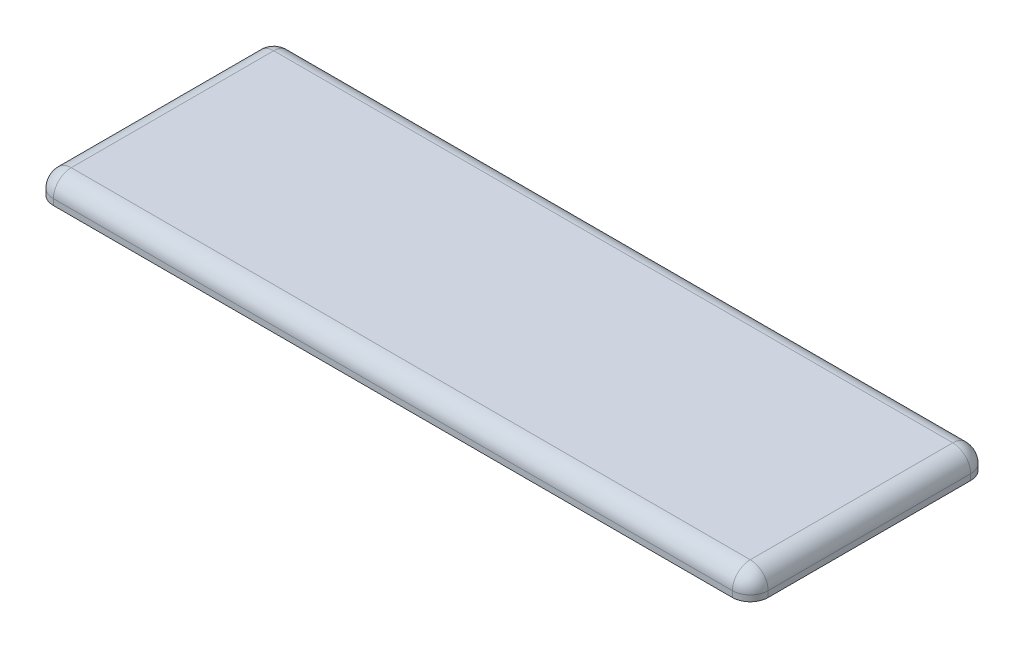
ISO-10303-21;
HEADER;
FILE_DESCRIPTION(('STEP AP214'),'2;1');
FILE_NAME('part.step','',(''),(''),'','','');
FILE_SCHEMA(('AUTOMOTIVE_DESIGN { 1 0 10303 214 1 1 1 1 }'));
ENDSEC;
DATA;
#1=APPLICATION_CONTEXT('core data for automotive mechanical design processes');
#2=APPLICATION_PROTOCOL_DEFINITION('international standard','automotive_design',2000,#1);
#3=PRODUCT_CONTEXT('',#1,'mechanical');
#4=PRODUCT('Part','Part','',(#3));
#5=PRODUCT_RELATED_PRODUCT_CATEGORY('part','',(#4));
#6=PRODUCT_DEFINITION_FORMATION('','',#4);
#7=PRODUCT_DEFINITION_CONTEXT('part definition',#1,'design');
#8=PRODUCT_DEFINITION('design','',#6,#7);
#9=PRODUCT_DEFINITION_SHAPE('','',#8);
#10=(LENGTH_UNIT() NAMED_UNIT(*) SI_UNIT(.MILLI.,.METRE.));
#11=(NAMED_UNIT(*) PLANE_ANGLE_UNIT() SI_UNIT($,.RADIAN.));
#12=(NAMED_UNIT(*) SI_UNIT($,.STERADIAN.) SOLID_ANGLE_UNIT());
#13=UNCERTAINTY_MEASURE_WITH_UNIT(LENGTH_MEASURE(1.E-05),#10,'distance_accuracy_value','');
#14=(GEOMETRIC_REPRESENTATION_CONTEXT(3) GLOBAL_UNCERTAINTY_ASSIGNED_CONTEXT((#13)) GLOBAL_UNIT_ASSIGNED_CONTEXT((#10,
#11,#12)) REPRESENTATION_CONTEXT('',''));
#15=CARTESIAN_POINT('',(0.,0.,0.));
#16=DIRECTION('',(0.,0.,1.));
#17=DIRECTION('',(1.,0.,0.));
#18=AXIS2_PLACEMENT_3D('',#15,#16,#17);
#19=CARTESIAN_POINT('',(0.,-12.,0.));
#20=DIRECTION('',(0.,-1.,0.));
#21=DIRECTION('',(1.,0.,0.));
#22=AXIS2_PLACEMENT_3D('',#19,#20,#21);
#23=TOROIDAL_SURFACE('',#22,2.52646924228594,0.5);
#24=CARTESIAN_POINT('',(-2.61984635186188,-12.0868240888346,-1.50000000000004));
#25=CARTESIAN_POINT('',(-2.6146056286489,-12.1127868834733,-1.50000000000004));
#26=CARTESIAN_POINT('',(-2.6069653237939,-12.1382162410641,-1.50000000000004));
#27=CARTESIAN_POINT('',(-2.58744492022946,-12.1872526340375,-1.50000000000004));
#28=CARTESIAN_POINT('',(-2.57558611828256,-12.2108681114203,-1.50000000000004));
#29=CARTESIAN_POINT('',(-2.54814782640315,-12.2557560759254,-1.50000000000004));
#30=CARTESIAN_POINT('',(-2.5325743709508,-12.2770322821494,-1.50000000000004));
#31=CARTESIAN_POINT('',(-2.49829698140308,-12.3169110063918,-1.50000000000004));
#32=CARTESIAN_POINT('',(-2.4795897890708,-12.3355107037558,-1.50000000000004));
#33=CARTESIAN_POINT('',(-2.4382275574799,-12.3710070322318,-1.50000000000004));
#34=CARTESIAN_POINT('',(-2.41538522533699,-12.387684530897,-1.50000000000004));
#35=CARTESIAN_POINT('',(-2.36749280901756,-12.4175635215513,-1.50000000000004));
#36=CARTESIAN_POINT('',(-2.34243872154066,-12.4307585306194,-1.50000000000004));
#37=CARTESIAN_POINT('',(-2.28699703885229,-12.4553182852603,-1.50000000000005));
#38=CARTESIAN_POINT('',(-2.25636595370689,-12.4661312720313,-1.50000000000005));
#39=CARTESIAN_POINT('',(-2.19383491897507,-12.4832837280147,-1.50000000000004));
#40=CARTESIAN_POINT('',(-2.16193300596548,-12.489615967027,-1.50000000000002));
#41=CARTESIAN_POINT('',(-2.1137037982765,-12.495886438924,-1.50000000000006));
#42=CARTESIAN_POINT('',(-2.09756786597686,-12.4974386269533,-1.50000000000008));
#43=CARTESIAN_POINT('',(-2.06528543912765,-12.4994932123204,-1.50000000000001));
#44=CARTESIAN_POINT('',(-2.04913917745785,-12.499999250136,-1.49999999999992));
#45=CARTESIAN_POINT('',(-2.03298962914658,-12.5,-1.49999999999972));
#46=B_SPLINE_CURVE_WITH_KNOTS('',3,(#24,#25,#26,#27,#28,#29,#30,#31,#32,#33,#34,#35,#36,#37,#38,
#39,#40,#41,#42,#43,#44,#45),.UNSPECIFIED.,.F.,.F.,(4,2,2,2,2,2,2,2,2,2,4),(0.,
0.0792805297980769,0.158166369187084,0.236924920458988,0.315765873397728,0.4002850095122,
0.48496039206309,0.582047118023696,0.679290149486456,0.727892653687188,0.776325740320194),.UNSPECIFIED.);
#47=CARTESIAN_POINT('',(-2.61984635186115,-12.0868240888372,-1.50000000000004));
#48=VERTEX_POINT('',#47);
#49=CARTESIAN_POINT('',(-2.03298962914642,-12.5,-1.50000000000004));
#50=VERTEX_POINT('',#49);
#51=EDGE_CURVE('E486',#48,#50,#46,.T.);
#52=ORIENTED_EDGE('',*,*,#51,.T.);
#53=CARTESIAN_POINT('',(0.,-12.5,0.));
#54=DIRECTION('',(0.,1.,0.));
#55=DIRECTION('',(-0.804676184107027,0.,-0.593713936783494));
#56=AXIS2_PLACEMENT_3D('',#53,#54,#55);
#57=CIRCLE('',#56,2.52646924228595);
#58=CARTESIAN_POINT('',(-2.03298962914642,-12.5,1.49999999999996));
#59=VERTEX_POINT('',#58);
#60=EDGE_CURVE('E1116',#59,#50,#57,.F.);
#61=ORIENTED_EDGE('',*,*,#60,.F.);
#62=CARTESIAN_POINT('',(-2.03298962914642,-12.5,1.49999999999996));
#63=CARTESIAN_POINT('',(-2.07531762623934,-12.5000242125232,1.49999999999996));
#64=CARTESIAN_POINT('',(-2.11780006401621,-12.4965162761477,1.49999999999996));
#65=CARTESIAN_POINT('',(-2.20168426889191,-12.4820054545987,1.49999999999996));
#66=CARTESIAN_POINT('',(-2.24307887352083,-12.4709617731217,1.49999999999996));
#67=CARTESIAN_POINT('',(-2.31349170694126,-12.4444784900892,1.49999999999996));
#68=CARTESIAN_POINT('',(-2.34312708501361,-12.430688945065,1.49999999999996));
#69=CARTESIAN_POINT('',(-2.39970026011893,-12.398445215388,1.49999999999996));
#70=CARTESIAN_POINT('',(-2.42664317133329,-12.3800001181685,1.49999999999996));
#71=CARTESIAN_POINT('',(-2.47704080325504,-12.3383936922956,1.49999999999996));
#72=CARTESIAN_POINT('',(-2.50046279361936,-12.3151923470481,1.49999999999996));
#73=CARTESIAN_POINT('',(-2.54230405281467,-12.2646524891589,1.49999999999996));
#74=CARTESIAN_POINT('',(-2.56073169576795,-12.237321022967,1.49999999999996));
#75=CARTESIAN_POINT('',(-2.58620759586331,-12.1893068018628,1.49999999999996));
#76=CARTESIAN_POINT('',(-2.59499365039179,-12.169532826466,1.49999999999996));
#77=CARTESIAN_POINT('',(-2.60966650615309,-12.1288990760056,1.49999999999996));
#78=CARTESIAN_POINT('',(-2.61554801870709,-12.108037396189,1.49999999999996));
#79=CARTESIAN_POINT('',(-2.61984635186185,-12.0868240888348,1.49999999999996));
#80=B_SPLINE_CURVE_WITH_KNOTS('',3,(#62,#63,#64,#65,#66,#67,#68,#69,#70,#71,#72,#73,#74,#75,#76,
#77,#78,#79),.UNSPECIFIED.,.F.,.F.,(4,2,2,2,2,2,2,2,4),(0.,0.12709127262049,0.254876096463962,
0.352536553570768,0.450007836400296,0.5483355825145,0.646497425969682,0.711203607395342,
0.776027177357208),.UNSPECIFIED.);
#81=CARTESIAN_POINT('',(-2.61984635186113,-12.0868240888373,1.49999999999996));
#82=VERTEX_POINT('',#81);
#83=EDGE_CURVE('E1925',#59,#82,#80,.T.);
#84=ORIENTED_EDGE('',*,*,#83,.T.);
#85=CARTESIAN_POINT('',(0.,-12.0868240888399,0.));
#86=DIRECTION('',(0.,1.,0.));
#87=DIRECTION('',(-1.,0.,0.));
#88=AXIS2_PLACEMENT_3D('',#85,#86,#87);
#89=CIRCLE('',#88,3.01887311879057);
#90=EDGE_CURVE('E1132',#48,#82,#89,.T.);
#91=ORIENTED_EDGE('',*,*,#90,.F.);
#92=EDGE_LOOP('',(#52,#61,#84,#91));
#93=FACE_BOUND('',#92,.T.);
#94=ADVANCED_FACE('F37',(#93),#23,.T.);
#95=CARTESIAN_POINT('',(0.,-12.5,0.));
#96=DIRECTION('',(0.,1.,0.));
#97=DIRECTION('',(-1.,0.,0.));
#98=AXIS2_PLACEMENT_3D('',#95,#96,#97);
#99=CYLINDRICAL_SURFACE('',#98,3.475);
#100=DIRECTION('',(0.,-1.,0.));
#101=VECTOR('',#100,1.);
#102=CARTESIAN_POINT('',(-3.13458529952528,-12.5,1.49999999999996));
#103=LINE('',#102,#101);
#104=CARTESIAN_POINT('',(-3.13458529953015,-9.50000000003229,1.49999999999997));
#105=VERTEX_POINT('',#104);
#106=CARTESIAN_POINT('',(-3.13458529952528,-3.,1.49999999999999));
#107=VERTEX_POINT('',#106);
#108=EDGE_CURVE('E1164',#105,#107,#103,.F.);
#109=ORIENTED_EDGE('',*,*,#108,.T.);
#110=CARTESIAN_POINT('',(0.,-3.,0.));
#111=DIRECTION('',(0.,1.,0.));
#112=DIRECTION('',(-1.,0.,0.));
#113=AXIS2_PLACEMENT_3D('',#110,#111,#112);
#114=CIRCLE('',#113,3.475);
#115=CARTESIAN_POINT('',(-3.13458529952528,-2.99999999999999,-1.50000000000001));
#116=VERTEX_POINT('',#115);
#117=EDGE_CURVE('E1141',#107,#116,#114,.F.);
#118=ORIENTED_EDGE('',*,*,#117,.T.);
#119=DIRECTION('',(0.,-1.,0.));
#120=VECTOR('',#119,1.);
#121=CARTESIAN_POINT('',(-3.13458529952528,-12.5,-1.50000000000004));
#122=LINE('',#121,#120);
#123=CARTESIAN_POINT('',(-3.13458529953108,-9.50000000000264,-1.50000000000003));
#124=VERTEX_POINT('',#123);
#125=EDGE_CURVE('E1163',#116,#124,#122,.T.);
#126=ORIENTED_EDGE('',*,*,#125,.T.);
#127=CARTESIAN_POINT('',(0.,-9.50000000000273,0.));
#128=DIRECTION('',(0.,1.,0.));
#129=DIRECTION('',(-1.,0.,0.));
#130=AXIS2_PLACEMENT_3D('',#127,#128,#129);
#131=CIRCLE('',#130,3.47500000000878);
#132=EDGE_CURVE('E1140',#105,#124,#131,.F.);
#133=ORIENTED_EDGE('',*,*,#132,.F.);
#134=EDGE_LOOP('',(#109,#118,#126,#133));
#135=FACE_BOUND('',#134,.T.);
#136=ADVANCED_FACE('F341',(#135),#99,.T.);
#137=CARTESIAN_POINT('',(0.,-9.50000000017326,0.));
#138=DIRECTION('',(0.,1.,0.));
#139=DIRECTION('',(-1.,0.,0.));
#140=AXIS2_PLACEMENT_3D('',#137,#138,#139);
#141=CONICAL_SURFACE('',#140,3.47499999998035,0.174532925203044);
#142=CARTESIAN_POINT('',(-2.61984635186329,-12.086824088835,1.49999999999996));
#143=CARTESIAN_POINT('',(-2.66360880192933,-11.8714288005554,1.49999999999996));
#144=CARTESIAN_POINT('',(-2.70711562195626,-11.6559817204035,1.49999999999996));
#145=CARTESIAN_POINT('',(-2.79367783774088,-11.2249976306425,1.49999999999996));
#146=CARTESIAN_POINT('',(-2.83673323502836,-11.0094606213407,1.49999999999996));
#147=CARTESIAN_POINT('',(-2.92245270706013,-10.5783090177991,1.49999999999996));
#148=CARTESIAN_POINT('',(-2.96511678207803,-10.3626944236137,1.49999999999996));
#149=CARTESIAN_POINT('',(-3.05009911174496,-9.93139632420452,1.49999999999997));
#150=CARTESIAN_POINT('',(-3.09241736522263,-9.71571281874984,1.49999999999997));
#151=CARTESIAN_POINT('',(-3.13458529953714,-9.50000000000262,1.49999999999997));
#152=B_SPLINE_CURVE_WITH_KNOTS('',3,(#142,#143,#144,#145,#146,#147,#148,#149,#150,#151),
.UNSPECIFIED.,.F.,.F.,(4,2,2,2,4),(0.,0.659387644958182,1.31877305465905,1.97815800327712,
2.63754518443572),.UNSPECIFIED.);
#153=EDGE_CURVE('E1142',#82,#105,#152,.T.);
#154=ORIENTED_EDGE('',*,*,#153,.T.);
#155=ORIENTED_EDGE('',*,*,#132,.T.);
#156=CARTESIAN_POINT('',(-3.13458529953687,-9.50000000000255,-1.50000000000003));
#157=CARTESIAN_POINT('',(-3.09241736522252,-9.71571281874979,-1.50000000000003));
#158=CARTESIAN_POINT('',(-3.05009911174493,-9.93139632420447,-1.50000000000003));
#159=CARTESIAN_POINT('',(-2.96511678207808,-10.3626944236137,-1.50000000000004));
#160=CARTESIAN_POINT('',(-2.92245270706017,-10.578309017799,-1.50000000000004));
#161=CARTESIAN_POINT('',(-2.83673323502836,-11.0094606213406,-1.50000000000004));
#162=CARTESIAN_POINT('',(-2.79367783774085,-11.2249976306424,-1.50000000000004));
#163=CARTESIAN_POINT('',(-2.70711562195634,-11.6559817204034,-1.50000000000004));
#164=CARTESIAN_POINT('',(-2.66360880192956,-11.8714288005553,-1.50000000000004));
#165=CARTESIAN_POINT('',(-2.61984635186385,-12.086824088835,-1.50000000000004));
#166=B_SPLINE_CURVE_WITH_KNOTS('',3,(#156,#157,#158,#159,#160,#161,#162,#163,#164,#165),
.UNSPECIFIED.,.F.,.F.,(4,2,2,2,4),(0.,0.659387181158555,1.31877212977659,1.97815753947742,
2.63754518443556),.UNSPECIFIED.);
#167=EDGE_CURVE('E1156',#124,#48,#166,.T.);
#168=ORIENTED_EDGE('',*,*,#167,.T.);
#169=ORIENTED_EDGE('',*,*,#90,.T.);
#170=EDGE_LOOP('',(#154,#155,#168,#169));
#171=FACE_BOUND('',#170,.T.);
#172=ADVANCED_FACE('F1068',(#171),#141,.T.);
#173=CARTESIAN_POINT('',(0.,-12.5,0.));
#174=DIRECTION('',(0.,-1.,0.));
#175=DIRECTION('',(1.,0.,0.));
#176=AXIS2_PLACEMENT_3D('',#173,#174,#175);
#177=PLANE('',#176);
#178=ORIENTED_EDGE('',*,*,#60,.T.);
#179=DIRECTION('',(1.,0.,0.));
#180=VECTOR('',#179,1.);
#181=CARTESIAN_POINT('',(-3.13458529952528,-12.5,-1.50000000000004));
#182=LINE('',#181,#180);
#183=CARTESIAN_POINT('',(-1.5,-12.5,-1.50000000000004));
#184=VERTEX_POINT('',#183);
#185=EDGE_CURVE('E1162',#50,#184,#182,.T.);
#186=ORIENTED_EDGE('',*,*,#185,.T.);
#187=DIRECTION('',(0.,0.,1.));
#188=VECTOR('',#187,1.);
#189=CARTESIAN_POINT('',(-1.5,-12.5,0.));
#190=LINE('',#189,#188);
#191=CARTESIAN_POINT('',(-1.5,-12.5,-2.03298962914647));
#192=VERTEX_POINT('',#191);
#193=EDGE_CURVE('E1873',#184,#192,#190,.F.);
#194=ORIENTED_EDGE('',*,*,#193,.T.);
#195=CARTESIAN_POINT('',(0.,-12.5,0.));
#196=DIRECTION('',(0.,1.,0.));
#197=DIRECTION('',(0.593713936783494,0.,-0.804676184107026));
#198=AXIS2_PLACEMENT_3D('',#195,#196,#197);
#199=CIRCLE('',#198,2.52646924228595);
#200=CARTESIAN_POINT('',(1.5,-12.5,-2.03298962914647));
#201=VERTEX_POINT('',#200);
#202=EDGE_CURVE('E1175',#201,#192,#199,.T.);
#203=ORIENTED_EDGE('',*,*,#202,.F.);
#204=DIRECTION('',(0.,0.,1.));
#205=VECTOR('',#204,1.);
#206=CARTESIAN_POINT('',(1.5,-12.5,0.));
#207=LINE('',#206,#205);
#208=CARTESIAN_POINT('',(1.5,-12.5,-1.50000000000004));
#209=VERTEX_POINT('',#208);
#210=EDGE_CURVE('E1887',#201,#209,#207,.T.);
#211=ORIENTED_EDGE('',*,*,#210,.T.);
#212=DIRECTION('',(1.,0.,0.));
#213=VECTOR('',#212,1.);
#214=CARTESIAN_POINT('',(0.,-12.5,-1.50000000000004));
#215=LINE('',#214,#213);
#216=CARTESIAN_POINT('',(2.03298962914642,-12.5,-1.50000000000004));
#217=VERTEX_POINT('',#216);
#218=EDGE_CURVE('E1885',#209,#217,#215,.T.);
#219=ORIENTED_EDGE('',*,*,#218,.T.);
#220=CARTESIAN_POINT('',(0.,-12.5,0.));
#221=DIRECTION('',(0.,1.,0.));
#222=DIRECTION('',(1.,0.,0.));
#223=AXIS2_PLACEMENT_3D('',#220,#221,#222);
#224=CIRCLE('',#223,2.52646924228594);
#225=CARTESIAN_POINT('',(2.52646924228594,-12.5,0.));
#226=VERTEX_POINT('',#225);
#227=EDGE_CURVE('E1215',#217,#226,#224,.F.);
#228=ORIENTED_EDGE('',*,*,#227,.T.);
#229=CARTESIAN_POINT('',(0.,-12.5,0.));
#230=DIRECTION('',(0.,1.,0.));
#231=DIRECTION('',(0.804676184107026,0.,0.593713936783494));
#232=AXIS2_PLACEMENT_3D('',#229,#230,#231);
#233=CIRCLE('',#232,2.52646924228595);
#234=CARTESIAN_POINT('',(2.03298962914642,-12.5,1.49999999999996));
#235=VERTEX_POINT('',#234);
#236=EDGE_CURVE('E1955',#226,#235,#233,.F.);
#237=ORIENTED_EDGE('',*,*,#236,.T.);
#238=DIRECTION('',(1.,0.,0.));
#239=VECTOR('',#238,1.);
#240=CARTESIAN_POINT('',(0.,-12.5,1.49999999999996));
#241=LINE('',#240,#239);
#242=CARTESIAN_POINT('',(1.5,-12.5,1.49999999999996));
#243=VERTEX_POINT('',#242);
#244=EDGE_CURVE('E1503',#235,#243,#241,.F.);
#245=ORIENTED_EDGE('',*,*,#244,.T.);
#246=DIRECTION('',(0.,0.,1.));
#247=VECTOR('',#246,1.);
#248=CARTESIAN_POINT('',(1.5,-12.5,0.));
#249=LINE('',#248,#247);
#250=CARTESIAN_POINT('',(1.5,-12.5,2.03298962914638));
#251=VERTEX_POINT('',#250);
#252=EDGE_CURVE('E1494',#243,#251,#249,.T.);
#253=ORIENTED_EDGE('',*,*,#252,.T.);
#254=CARTESIAN_POINT('',(0.,-12.5,0.));
#255=DIRECTION('',(0.,1.,0.));
#256=DIRECTION('',(-0.593713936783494,0.,0.804676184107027));
#257=AXIS2_PLACEMENT_3D('',#254,#255,#256);
#258=CIRCLE('',#257,2.52646924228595);
#259=CARTESIAN_POINT('',(-1.5,-12.5,2.03298962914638));
#260=VERTEX_POINT('',#259);
#261=EDGE_CURVE('E1893',#260,#251,#258,.T.);
#262=ORIENTED_EDGE('',*,*,#261,.F.);
#263=DIRECTION('',(0.,0.,1.));
#264=VECTOR('',#263,1.);
#265=CARTESIAN_POINT('',(-1.5,-12.5,0.));
#266=LINE('',#265,#264);
#267=CARTESIAN_POINT('',(-1.5,-12.5,1.49999999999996));
#268=VERTEX_POINT('',#267);
#269=EDGE_CURVE('E1806',#260,#268,#266,.F.);
#270=ORIENTED_EDGE('',*,*,#269,.T.);
#271=DIRECTION('',(1.,0.,0.));
#272=VECTOR('',#271,1.);
#273=CARTESIAN_POINT('',(-3.13458529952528,-12.5,1.49999999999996));
#274=LINE('',#273,#272);
#275=EDGE_CURVE('E1149',#268,#59,#274,.F.);
#276=ORIENTED_EDGE('',*,*,#275,.T.);
#277=EDGE_LOOP('',(#178,#186,#194,#203,#211,#219,#228,#237,#245,#253,#262,#270,#276));
#278=FACE_BOUND('',#277,.T.);
#279=ADVANCED_FACE('F1058',(#278),#177,.T.);
#280=CARTESIAN_POINT('',(40.,-12.,0.));
#281=DIRECTION('',(0.,1.,0.));
#282=DIRECTION('',(-1.,0.,0.));
#283=AXIS2_PLACEMENT_3D('',#280,#281,#282);
#284=TOROIDAL_SURFACE('',#283,2.52646924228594,0.5);
#285=CARTESIAN_POINT('',(41.5,-12.0868240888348,-2.61984635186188));
#286=CARTESIAN_POINT('',(41.5,-12.1127868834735,-2.61460562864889));
#287=CARTESIAN_POINT('',(41.5,-12.1382162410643,-2.60696532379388));
#288=CARTESIAN_POINT('',(41.5,-12.1872526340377,-2.5874449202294));
#289=CARTESIAN_POINT('',(41.5,-12.2108681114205,-2.57558611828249));
#290=CARTESIAN_POINT('',(41.5,-12.2557560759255,-2.54814782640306));
#291=CARTESIAN_POINT('',(41.5,-12.2770322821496,-2.53257437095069));
#292=CARTESIAN_POINT('',(41.5,-12.316911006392,-2.49829698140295));
#293=CARTESIAN_POINT('',(41.5,-12.335510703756,-2.47958978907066));
#294=CARTESIAN_POINT('',(41.5,-12.371007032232,-2.43822755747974));
#295=CARTESIAN_POINT('',(41.5,-12.3876845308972,-2.41538522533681));
#296=CARTESIAN_POINT('',(41.5,-12.4175635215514,-2.36749280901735));
#297=CARTESIAN_POINT('',(41.5,-12.4307585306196,-2.34243872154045));
#298=CARTESIAN_POINT('',(41.5,-12.4553182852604,-2.28699703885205));
#299=CARTESIAN_POINT('',(41.5,-12.4661312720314,-2.25636595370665));
#300=CARTESIAN_POINT('',(41.5,-12.4832837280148,-2.19383491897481));
#301=CARTESIAN_POINT('',(41.5,-12.489615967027,-2.1619330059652));
#302=CARTESIAN_POINT('',(41.5,-12.4958864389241,-2.11370379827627));
#303=CARTESIAN_POINT('',(41.5,-12.4974386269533,-2.09756786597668));
#304=CARTESIAN_POINT('',(41.5,-12.4994932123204,-2.06528543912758));
#305=CARTESIAN_POINT('',(41.4999999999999,-12.499999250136,-2.04913917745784));
#306=CARTESIAN_POINT('',(41.4999999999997,-12.5,-2.03298962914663));
#307=B_SPLINE_CURVE_WITH_KNOTS('',3,(#285,#286,#287,#288,#289,#290,#291,#292,#293,#294,#295,
#296,#297,#298,#299,#300,#301,#302,#303,#304,#305,#306),.UNSPECIFIED.,.F.,.F.,(4,2,2,2,2,2,2,2,
2,2,4),(0.,0.079280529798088,0.158166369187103,0.236924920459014,0.315765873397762,
0.400285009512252,0.484960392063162,0.582047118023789,0.679290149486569,0.727892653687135,
0.776325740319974),.UNSPECIFIED.);
#308=CARTESIAN_POINT('',(41.5,-12.0868240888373,-2.61984635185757));
#309=VERTEX_POINT('',#308);
#310=CARTESIAN_POINT('',(41.5,-12.5,-2.03298962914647));
#311=VERTEX_POINT('',#310);
#312=EDGE_CURVE('E1302',#309,#311,#307,.T.);
#313=ORIENTED_EDGE('',*,*,#312,.T.);
#314=CARTESIAN_POINT('',(40.,-12.5,0.));
#315=DIRECTION('',(0.,1.,0.));
#316=DIRECTION('',(0.593713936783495,0.,-0.804676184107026));
#317=AXIS2_PLACEMENT_3D('',#314,#315,#316);
#318=CIRCLE('',#317,2.52646924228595);
#319=CARTESIAN_POINT('',(38.5,-12.5,-2.03298962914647));
#320=VERTEX_POINT('',#319);
#321=EDGE_CURVE('E1597',#311,#320,#318,.T.);
#322=ORIENTED_EDGE('',*,*,#321,.T.);
#323=CARTESIAN_POINT('',(38.5,-12.5,-2.03298962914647));
#324=CARTESIAN_POINT('',(38.5,-12.5000242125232,-2.07531762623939));
#325=CARTESIAN_POINT('',(38.5,-12.4965162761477,-2.11780006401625));
#326=CARTESIAN_POINT('',(38.5,-12.4820054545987,-2.20168426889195));
#327=CARTESIAN_POINT('',(38.5,-12.4709617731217,-2.24307887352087));
#328=CARTESIAN_POINT('',(38.5,-12.4444784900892,-2.3134917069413));
#329=CARTESIAN_POINT('',(38.5,-12.430688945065,-2.34312708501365));
#330=CARTESIAN_POINT('',(38.5,-12.3984452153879,-2.39970026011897));
#331=CARTESIAN_POINT('',(38.5,-12.3800001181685,-2.42664317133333));
#332=CARTESIAN_POINT('',(38.5,-12.3383936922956,-2.47704080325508));
#333=CARTESIAN_POINT('',(38.5,-12.3151923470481,-2.50046279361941));
#334=CARTESIAN_POINT('',(38.5,-12.2646524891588,-2.54230405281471));
#335=CARTESIAN_POINT('',(38.5,-12.237321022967,-2.56073169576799));
#336=CARTESIAN_POINT('',(38.5,-12.1893068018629,-2.58620759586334));
#337=CARTESIAN_POINT('',(38.5,-12.169532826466,-2.5949936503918));
#338=CARTESIAN_POINT('',(38.5,-12.1288990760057,-2.60966650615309));
#339=CARTESIAN_POINT('',(38.5,-12.1080373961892,-2.61554801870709));
#340=CARTESIAN_POINT('',(38.5,-12.086824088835,-2.61984635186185));
#341=B_SPLINE_CURVE_WITH_KNOTS('',3,(#323,#324,#325,#326,#327,#328,#329,#330,#331,#332,#333,
#334,#335,#336,#337,#338,#339,#340),.UNSPECIFIED.,.F.,.F.,(4,2,2,2,2,2,2,2,4),(0.,
0.127091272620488,0.254876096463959,0.352536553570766,0.450007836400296,0.5483355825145,
0.646497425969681,0.711203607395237,0.776027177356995),.UNSPECIFIED.);
#342=CARTESIAN_POINT('',(38.5,-12.0868240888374,-2.61984635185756));
#343=VERTEX_POINT('',#342);
#344=EDGE_CURVE('E1602',#320,#343,#341,.T.);
#345=ORIENTED_EDGE('',*,*,#344,.T.);
#346=CARTESIAN_POINT('',(40.,-12.0868240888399,0.));
#347=DIRECTION('',(0.,1.,0.));
#348=DIRECTION('',(-1.,0.,0.));
#349=AXIS2_PLACEMENT_3D('',#346,#347,#348);
#350=CIRCLE('',#349,3.01887311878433);
#351=EDGE_CURVE('E1339',#309,#343,#350,.T.);
#352=ORIENTED_EDGE('',*,*,#351,.F.);
#353=EDGE_LOOP('',(#313,#322,#345,#352));
#354=FACE_BOUND('',#353,.T.);
#355=ADVANCED_FACE('F1048',(#354),#284,.T.);
#356=CARTESIAN_POINT('',(40.,-12.,0.));
#357=DIRECTION('',(0.,1.,0.));
#358=DIRECTION('',(-1.,0.,0.));
#359=AXIS2_PLACEMENT_3D('',#356,#357,#358);
#360=TOROIDAL_SURFACE('',#359,2.52646924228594,0.5);
#361=CARTESIAN_POINT('',(38.5,-12.0868240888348,2.61984635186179));
#362=CARTESIAN_POINT('',(38.5,-12.1127868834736,2.6146056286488));
#363=CARTESIAN_POINT('',(38.5,-12.1382162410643,2.60696532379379));
#364=CARTESIAN_POINT('',(38.5,-12.1872526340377,2.58744492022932));
#365=CARTESIAN_POINT('',(38.5,-12.2108681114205,2.57558611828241));
#366=CARTESIAN_POINT('',(38.5,-12.2557560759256,2.54814782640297));
#367=CARTESIAN_POINT('',(38.5,-12.2770322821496,2.53257437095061));
#368=CARTESIAN_POINT('',(38.5,-12.316911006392,2.49829698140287));
#369=CARTESIAN_POINT('',(38.5,-12.335510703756,2.47958978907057));
#370=CARTESIAN_POINT('',(38.5,-12.371007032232,2.43822755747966));
#371=CARTESIAN_POINT('',(38.5,-12.3876845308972,2.41538522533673));
#372=CARTESIAN_POINT('',(38.5,-12.4175635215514,2.36749280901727));
#373=CARTESIAN_POINT('',(38.5,-12.4307585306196,2.34243872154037));
#374=CARTESIAN_POINT('',(38.5,-12.4553182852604,2.28699703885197));
#375=CARTESIAN_POINT('',(38.5,-12.4661312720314,2.25636595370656));
#376=CARTESIAN_POINT('',(38.5,-12.4832837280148,2.19383491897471));
#377=CARTESIAN_POINT('',(38.5000000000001,-12.4896159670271,2.16193300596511));
#378=CARTESIAN_POINT('',(38.5,-12.4958864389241,2.11370379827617));
#379=CARTESIAN_POINT('',(38.5,-12.4974386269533,2.09756786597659));
#380=CARTESIAN_POINT('',(38.5,-12.4994932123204,2.06528543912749));
#381=CARTESIAN_POINT('',(38.5000000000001,-12.4999992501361,2.04913917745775));
#382=CARTESIAN_POINT('',(38.5000000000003,-12.5,2.03298962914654));
#383=B_SPLINE_CURVE_WITH_KNOTS('',3,(#361,#362,#363,#364,#365,#366,#367,#368,#369,#370,#371,
#372,#373,#374,#375,#376,#377,#378,#379,#380,#381,#382),.UNSPECIFIED.,.F.,.F.,(4,2,2,2,2,2,2,2,
2,2,4),(0.,0.0792805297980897,0.158166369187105,0.236924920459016,0.315765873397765,
0.400285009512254,0.484960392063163,0.582047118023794,0.679290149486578,0.727892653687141,
0.776325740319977),.UNSPECIFIED.);
#384=CARTESIAN_POINT('',(38.5,-12.0868240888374,2.61984635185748));
#385=VERTEX_POINT('',#384);
#386=CARTESIAN_POINT('',(38.5,-12.5,2.03298962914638));
#387=VERTEX_POINT('',#386);
#388=EDGE_CURVE('E1301',#385,#387,#383,.T.);
#389=ORIENTED_EDGE('',*,*,#388,.T.);
#390=CARTESIAN_POINT('',(40.,-12.5,0.));
#391=DIRECTION('',(0.,1.,0.));
#392=DIRECTION('',(-0.593713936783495,0.,0.804676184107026));
#393=AXIS2_PLACEMENT_3D('',#390,#391,#392);
#394=CIRCLE('',#393,2.52646924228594);
#395=CARTESIAN_POINT('',(41.5,-12.5,2.03298962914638));
#396=VERTEX_POINT('',#395);
#397=EDGE_CURVE('E1608',#387,#396,#394,.T.);
#398=ORIENTED_EDGE('',*,*,#397,.T.);
#399=CARTESIAN_POINT('',(41.5,-12.5,2.03298962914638));
#400=CARTESIAN_POINT('',(41.5,-12.5000242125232,2.0753176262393));
#401=CARTESIAN_POINT('',(41.5,-12.4965162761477,2.11780006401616));
#402=CARTESIAN_POINT('',(41.5,-12.4820054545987,2.20168426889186));
#403=CARTESIAN_POINT('',(41.5,-12.4709617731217,2.24307887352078));
#404=CARTESIAN_POINT('',(41.5,-12.4444784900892,2.31349170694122));
#405=CARTESIAN_POINT('',(41.5,-12.430688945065,2.34312708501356));
#406=CARTESIAN_POINT('',(41.5,-12.398445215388,2.39970026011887));
#407=CARTESIAN_POINT('',(41.5,-12.3800001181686,2.42664317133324));
#408=CARTESIAN_POINT('',(41.5,-12.3383936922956,2.47704080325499));
#409=CARTESIAN_POINT('',(41.5,-12.3151923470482,2.50046279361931));
#410=CARTESIAN_POINT('',(41.5,-12.2646524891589,2.54230405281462));
#411=CARTESIAN_POINT('',(41.5,-12.237321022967,2.5607316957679));
#412=CARTESIAN_POINT('',(41.5,-12.1893068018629,2.58620759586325));
#413=CARTESIAN_POINT('',(41.5,-12.1695328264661,2.59499365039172));
#414=CARTESIAN_POINT('',(41.5,-12.1288990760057,2.60966650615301));
#415=CARTESIAN_POINT('',(41.5,-12.1080373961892,2.615548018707));
#416=CARTESIAN_POINT('',(41.5,-12.086824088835,2.61984635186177));
#417=B_SPLINE_CURVE_WITH_KNOTS('',3,(#399,#400,#401,#402,#403,#404,#405,#406,#407,#408,#409,
#410,#411,#412,#413,#414,#415,#416),.UNSPECIFIED.,.F.,.F.,(4,2,2,2,2,2,2,2,4),(0.,
0.127091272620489,0.254876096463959,0.352536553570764,0.450007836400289,0.54833558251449,
0.64649742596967,0.711203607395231,0.776027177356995),.UNSPECIFIED.);
#418=CARTESIAN_POINT('',(41.5,-12.0868240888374,2.61984635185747));
#419=VERTEX_POINT('',#418);
#420=EDGE_CURVE('E1298',#396,#419,#417,.T.);
#421=ORIENTED_EDGE('',*,*,#420,.T.);
#422=CARTESIAN_POINT('',(40.,-12.0868240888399,0.));
#423=DIRECTION('',(0.,1.,0.));
#424=DIRECTION('',(-1.,0.,0.));
#425=AXIS2_PLACEMENT_3D('',#422,#423,#424);
#426=CIRCLE('',#425,3.01887311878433);
#427=EDGE_CURVE('E1637',#385,#419,#426,.T.);
#428=ORIENTED_EDGE('',*,*,#427,.F.);
#429=EDGE_LOOP('',(#389,#398,#421,#428));
#430=FACE_BOUND('',#429,.T.);
#431=ADVANCED_FACE('F1038',(#430),#360,.T.);
#432=CARTESIAN_POINT('',(0.,-12.,0.));
#433=DIRECTION('',(0.,-1.,0.));
#434=DIRECTION('',(1.,0.,0.));
#435=AXIS2_PLACEMENT_3D('',#432,#433,#434);
#436=TOROIDAL_SURFACE('',#435,2.52646924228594,0.5);
#437=CARTESIAN_POINT('',(1.5,-12.0868240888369,-2.61984635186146));
#438=CARTESIAN_POINT('',(1.5,-12.1127868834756,-2.61460562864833));
#439=CARTESIAN_POINT('',(1.5,-12.1382162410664,-2.60696532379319));
#440=CARTESIAN_POINT('',(1.5,-12.1872526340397,-2.58744492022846));
#441=CARTESIAN_POINT('',(1.5,-12.2108681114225,-2.57558611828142));
#442=CARTESIAN_POINT('',(1.5,-12.2557560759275,-2.54814782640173));
#443=CARTESIAN_POINT('',(1.5,-12.2770322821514,-2.53257437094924));
#444=CARTESIAN_POINT('',(1.5,-12.3169110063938,-2.49829698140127));
#445=CARTESIAN_POINT('',(1.5,-12.3355107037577,-2.47958978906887));
#446=CARTESIAN_POINT('',(1.5,-12.3710070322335,-2.43822755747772));
#447=CARTESIAN_POINT('',(1.5,-12.3876845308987,-2.41538522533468));
#448=CARTESIAN_POINT('',(1.5,-12.4175635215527,-2.36749280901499));
#449=CARTESIAN_POINT('',(1.5,-12.4307585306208,-2.34243872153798));
#450=CARTESIAN_POINT('',(1.5,-12.4553182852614,-2.28699703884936));
#451=CARTESIAN_POINT('',(1.50000000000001,-12.4661312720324,-2.25636595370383));
#452=CARTESIAN_POINT('',(1.49999999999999,-12.4832837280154,-2.19383491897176));
#453=CARTESIAN_POINT('',(1.49999999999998,-12.4896159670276,-2.16193300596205));
#454=CARTESIAN_POINT('',(1.50000000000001,-12.4958864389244,-2.11370379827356));
#455=CARTESIAN_POINT('',(1.50000000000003,-12.4974386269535,-2.09756786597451));
#456=CARTESIAN_POINT('',(1.49999999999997,-12.4994932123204,-2.0652854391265));
#457=CARTESIAN_POINT('',(1.49999999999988,-12.499999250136,-2.04913917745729));
#458=CARTESIAN_POINT('',(1.49999999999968,-12.5,-2.03298962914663));
#459=B_SPLINE_CURVE_WITH_KNOTS('',3,(#437,#438,#439,#440,#441,#442,#443,#444,#445,#446,#447,
#448,#449,#450,#451,#452,#453,#454,#455,#456,#457,#458),.UNSPECIFIED.,.F.,.F.,(4,2,2,2,2,2,2,2,
2,2,4),(0.,0.0792805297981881,0.158166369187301,0.236924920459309,0.315765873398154,
0.400285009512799,0.484960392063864,0.582047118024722,0.679290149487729,0.727892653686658,
0.776325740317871),.UNSPECIFIED.);
#460=CARTESIAN_POINT('',(1.5,-12.0868240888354,-2.61984635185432));
#461=VERTEX_POINT('',#460);
#462=EDGE_CURVE('E1825',#461,#201,#459,.T.);
#463=ORIENTED_EDGE('',*,*,#462,.T.);
#464=ORIENTED_EDGE('',*,*,#202,.T.);
#465=CARTESIAN_POINT('',(-1.5,-12.5,-2.03298962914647));
#466=CARTESIAN_POINT('',(-1.5,-12.5000242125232,-2.07531762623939));
#467=CARTESIAN_POINT('',(-1.5,-12.4965162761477,-2.11780006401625));
#468=CARTESIAN_POINT('',(-1.5,-12.4820054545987,-2.20168426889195));
#469=CARTESIAN_POINT('',(-1.5,-12.4709617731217,-2.24307887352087));
#470=CARTESIAN_POINT('',(-1.5,-12.4444784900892,-2.31349170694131));
#471=CARTESIAN_POINT('',(-1.5,-12.430688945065,-2.34312708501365));
#472=CARTESIAN_POINT('',(-1.5,-12.3984452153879,-2.39970026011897));
#473=CARTESIAN_POINT('',(-1.5,-12.3800001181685,-2.42664317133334));
#474=CARTESIAN_POINT('',(-1.5,-12.3383936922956,-2.47704080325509));
#475=CARTESIAN_POINT('',(-1.5,-12.3151923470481,-2.50046279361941));
#476=CARTESIAN_POINT('',(-1.5,-12.2646524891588,-2.54230405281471));
#477=CARTESIAN_POINT('',(-1.5,-12.237321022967,-2.56073169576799));
#478=CARTESIAN_POINT('',(-1.5,-12.1893068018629,-2.58620759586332));
#479=CARTESIAN_POINT('',(-1.5,-12.1695328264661,-2.59499365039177));
#480=CARTESIAN_POINT('',(-1.5,-12.1288990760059,-2.60966650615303));
#481=CARTESIAN_POINT('',(-1.5,-12.1080373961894,-2.61554801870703));
#482=CARTESIAN_POINT('',(-1.5,-12.0868240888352,-2.6198463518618));
#483=B_SPLINE_CURVE_WITH_KNOTS('',3,(#465,#466,#467,#468,#469,#470,#471,#472,#473,#474,#475,
#476,#477,#478,#479,#480,#481,#482),.UNSPECIFIED.,.F.,.F.,(4,2,2,2,2,2,2,2,4),(0.,
0.127091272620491,0.254876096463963,0.352536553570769,0.450007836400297,0.548335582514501,
0.646497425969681,0.7112036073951,0.776027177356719),.UNSPECIFIED.);
#484=CARTESIAN_POINT('',(-1.5,-12.0868240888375,-2.61984635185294));
#485=VERTEX_POINT('',#484);
#486=EDGE_CURVE('E1834',#192,#485,#483,.T.);
#487=ORIENTED_EDGE('',*,*,#486,.T.);
#488=CARTESIAN_POINT('',(0.,-12.0868240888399,0.));
#489=DIRECTION('',(0.,1.,0.));
#490=DIRECTION('',(-1.,0.,0.));
#491=AXIS2_PLACEMENT_3D('',#488,#489,#490);
#492=CIRCLE('',#491,3.01887311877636);
#493=EDGE_CURVE('E1846',#461,#485,#492,.T.);
#494=ORIENTED_EDGE('',*,*,#493,.F.);
#495=EDGE_LOOP('',(#463,#464,#487,#494));
#496=FACE_BOUND('',#495,.T.);
#497=ADVANCED_FACE('F1028',(#496),#436,.T.);
#498=CARTESIAN_POINT('',(-3.13458529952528,-12.5,-1.50000000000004));
#499=DIRECTION('',(0.,0.,1.));
#500=DIRECTION('',(0.,-1.,0.));
#501=AXIS2_PLACEMENT_3D('',#498,#499,#500);
#502=PLANE('',#501);
#503=ORIENTED_EDGE('',*,*,#51,.F.);
#504=ORIENTED_EDGE('',*,*,#167,.F.);
#505=ORIENTED_EDGE('',*,*,#125,.F.);
#506=DIRECTION('',(1.,0.,0.));
#507=VECTOR('',#506,1.);
#508=CARTESIAN_POINT('',(-3.13458529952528,-2.99999999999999,-1.50000000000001));
#509=LINE('',#508,#507);
#510=CARTESIAN_POINT('',(-1.5,-2.99999999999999,-1.50000000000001));
#511=VERTEX_POINT('',#510);
#512=EDGE_CURVE('E1172',#511,#116,#509,.F.);
#513=ORIENTED_EDGE('',*,*,#512,.F.);
#514=DIRECTION('',(0.,-1.,0.));
#515=VECTOR('',#514,1.);
#516=CARTESIAN_POINT('',(-1.5,-12.5,-1.50000000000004));
#517=LINE('',#516,#515);
#518=EDGE_CURVE('E1176',#511,#184,#517,.T.);
#519=ORIENTED_EDGE('',*,*,#518,.T.);
#520=ORIENTED_EDGE('',*,*,#185,.F.);
#521=EDGE_LOOP('',(#503,#504,#505,#513,#519,#520));
#522=FACE_BOUND('',#521,.T.);
#523=ADVANCED_FACE('F1018',(#522),#502,.F.);
#524=CARTESIAN_POINT('',(-3.13458529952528,-12.5,1.49999999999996));
#525=DIRECTION('',(0.,0.,-1.));
#526=DIRECTION('',(1.,0.,0.));
#527=AXIS2_PLACEMENT_3D('',#524,#525,#526);
#528=PLANE('',#527);
#529=ORIENTED_EDGE('',*,*,#83,.F.);
#530=ORIENTED_EDGE('',*,*,#275,.F.);
#531=DIRECTION('',(0.,-1.,0.));
#532=VECTOR('',#531,1.);
#533=CARTESIAN_POINT('',(-1.5,-12.5,1.49999999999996));
#534=LINE('',#533,#532);
#535=CARTESIAN_POINT('',(-1.5,-3.,1.49999999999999));
#536=VERTEX_POINT('',#535);
#537=EDGE_CURVE('E1414',#268,#536,#534,.F.);
#538=ORIENTED_EDGE('',*,*,#537,.T.);
#539=DIRECTION('',(1.,0.,0.));
#540=VECTOR('',#539,1.);
#541=CARTESIAN_POINT('',(-3.13458529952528,-3.,1.49999999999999));
#542=LINE('',#541,#540);
#543=EDGE_CURVE('E1167',#107,#536,#542,.T.);
#544=ORIENTED_EDGE('',*,*,#543,.F.);
#545=ORIENTED_EDGE('',*,*,#108,.F.);
#546=ORIENTED_EDGE('',*,*,#153,.F.);
#547=EDGE_LOOP('',(#529,#530,#538,#544,#545,#546));
#548=FACE_BOUND('',#547,.T.);
#549=ADVANCED_FACE('F1008',(#548),#528,.F.);
#550=CARTESIAN_POINT('',(0.,-12.,0.));
#551=DIRECTION('',(0.,-1.,0.));
#552=DIRECTION('',(1.,0.,0.));
#553=AXIS2_PLACEMENT_3D('',#550,#551,#552);
#554=TOROIDAL_SURFACE('',#553,2.52646924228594,0.5);
#555=CARTESIAN_POINT('',(-1.5,-12.0868240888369,2.61984635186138));
#556=CARTESIAN_POINT('',(-1.5,-12.1127868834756,2.61460562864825));
#557=CARTESIAN_POINT('',(-1.5,-12.1382162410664,2.60696532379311));
#558=CARTESIAN_POINT('',(-1.5,-12.1872526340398,2.58744492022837));
#559=CARTESIAN_POINT('',(-1.5,-12.2108681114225,2.57558611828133));
#560=CARTESIAN_POINT('',(-1.5,-12.2557560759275,2.54814782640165));
#561=CARTESIAN_POINT('',(-1.5,-12.2770322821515,2.53257437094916));
#562=CARTESIAN_POINT('',(-1.5,-12.3169110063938,2.49829698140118));
#563=CARTESIAN_POINT('',(-1.5,-12.3355107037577,2.47958978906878));
#564=CARTESIAN_POINT('',(-1.5,-12.3710070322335,2.43822755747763));
#565=CARTESIAN_POINT('',(-1.5,-12.3876845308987,2.41538522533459));
#566=CARTESIAN_POINT('',(-1.5,-12.4175635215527,2.3674928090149));
#567=CARTESIAN_POINT('',(-1.5,-12.4307585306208,2.34243872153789));
#568=CARTESIAN_POINT('',(-1.5,-12.4553182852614,2.28699703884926));
#569=CARTESIAN_POINT('',(-1.50000000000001,-12.4661312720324,2.25636595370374));
#570=CARTESIAN_POINT('',(-1.49999999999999,-12.4832837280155,2.19383491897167));
#571=CARTESIAN_POINT('',(-1.49999999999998,-12.4896159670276,2.16193300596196));
#572=CARTESIAN_POINT('',(-1.50000000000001,-12.4958864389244,2.11370379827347));
#573=CARTESIAN_POINT('',(-1.50000000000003,-12.4974386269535,2.09756786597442));
#574=CARTESIAN_POINT('',(-1.49999999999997,-12.4994932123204,2.06528543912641));
#575=CARTESIAN_POINT('',(-1.49999999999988,-12.4999992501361,2.04913917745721));
#576=CARTESIAN_POINT('',(-1.49999999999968,-12.5,2.03298962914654));
#577=B_SPLINE_CURVE_WITH_KNOTS('',3,(#555,#556,#557,#558,#559,#560,#561,#562,#563,#564,#565,
#566,#567,#568,#569,#570,#571,#572,#573,#574,#575,#576),.UNSPECIFIED.,.F.,.F.,(4,2,2,2,2,2,2,2,
2,2,4),(0.,0.0792805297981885,0.158166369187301,0.236924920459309,0.315765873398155,
0.400285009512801,0.484960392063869,0.582047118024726,0.679290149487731,0.727892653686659,
0.776325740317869),.UNSPECIFIED.);
#578=CARTESIAN_POINT('',(-1.5,-12.0868240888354,2.61984635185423));
#579=VERTEX_POINT('',#578);
#580=EDGE_CURVE('E1413',#579,#260,#577,.T.);
#581=ORIENTED_EDGE('',*,*,#580,.T.);
#582=ORIENTED_EDGE('',*,*,#261,.T.);
#583=CARTESIAN_POINT('',(1.5,-12.5,2.03298962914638));
#584=CARTESIAN_POINT('',(1.5,-12.5000242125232,2.0753176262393));
#585=CARTESIAN_POINT('',(1.5,-12.4965162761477,2.11780006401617));
#586=CARTESIAN_POINT('',(1.5,-12.4820054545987,2.20168426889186));
#587=CARTESIAN_POINT('',(1.5,-12.4709617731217,2.24307887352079));
#588=CARTESIAN_POINT('',(1.5,-12.4444784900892,2.31349170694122));
#589=CARTESIAN_POINT('',(1.5,-12.430688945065,2.34312708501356));
#590=CARTESIAN_POINT('',(1.5,-12.398445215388,2.39970026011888));
#591=CARTESIAN_POINT('',(1.5,-12.3800001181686,2.42664317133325));
#592=CARTESIAN_POINT('',(1.5,-12.3383936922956,2.477040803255));
#593=CARTESIAN_POINT('',(1.5,-12.3151923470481,2.50046279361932));
#594=CARTESIAN_POINT('',(1.5,-12.2646524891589,2.54230405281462));
#595=CARTESIAN_POINT('',(1.5,-12.237321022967,2.56073169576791));
#596=CARTESIAN_POINT('',(1.5,-12.1893068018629,2.58620759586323));
#597=CARTESIAN_POINT('',(1.5,-12.1695328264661,2.59499365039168));
#598=CARTESIAN_POINT('',(1.5,-12.1288990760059,2.60966650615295));
#599=CARTESIAN_POINT('',(1.5,-12.1080373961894,2.61554801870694));
#600=CARTESIAN_POINT('',(1.5,-12.0868240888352,2.61984635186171));
#601=B_SPLINE_CURVE_WITH_KNOTS('',3,(#583,#584,#585,#586,#587,#588,#589,#590,#591,#592,#593,
#594,#595,#596,#597,#598,#599,#600),.UNSPECIFIED.,.F.,.F.,(4,2,2,2,2,2,2,2,4),(0.,
0.12709127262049,0.254876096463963,0.352536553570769,0.450007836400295,0.548335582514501,
0.64649742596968,0.7112036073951,0.776027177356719),.UNSPECIFIED.);
#602=CARTESIAN_POINT('',(1.5,-12.0868240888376,2.61984635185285));
#603=VERTEX_POINT('',#602);
#604=EDGE_CURVE('E1148',#251,#603,#601,.T.);
#605=ORIENTED_EDGE('',*,*,#604,.T.);
#606=CARTESIAN_POINT('',(0.,-12.0868240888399,0.));
#607=DIRECTION('',(0.,1.,0.));
#608=DIRECTION('',(-1.,0.,0.));
#609=AXIS2_PLACEMENT_3D('',#606,#607,#608);
#610=CIRCLE('',#609,3.01887311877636);
#611=EDGE_CURVE('E1422',#579,#603,#610,.T.);
#612=ORIENTED_EDGE('',*,*,#611,.F.);
#613=EDGE_LOOP('',(#581,#582,#605,#612));
#614=FACE_BOUND('',#613,.T.);
#615=ADVANCED_FACE('F998',(#614),#554,.T.);
#616=CARTESIAN_POINT('',(0.,-12.,0.));
#617=DIRECTION('',(0.,-1.,0.));
#618=DIRECTION('',(1.,0.,0.));
#619=AXIS2_PLACEMENT_3D('',#616,#617,#618);
#620=TOROIDAL_SURFACE('',#619,2.52646924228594,0.5);
#621=ORIENTED_EDGE('',*,*,#227,.F.);
#622=CARTESIAN_POINT('',(2.03298962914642,-12.5,-1.50000000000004));
#623=CARTESIAN_POINT('',(2.07531762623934,-12.5000242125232,-1.50000000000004));
#624=CARTESIAN_POINT('',(2.11780006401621,-12.4965162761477,-1.50000000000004));
#625=CARTESIAN_POINT('',(2.20168426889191,-12.4820054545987,-1.50000000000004));
#626=CARTESIAN_POINT('',(2.24307887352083,-12.4709617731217,-1.50000000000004));
#627=CARTESIAN_POINT('',(2.31349170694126,-12.4444784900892,-1.50000000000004));
#628=CARTESIAN_POINT('',(2.34312708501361,-12.430688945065,-1.50000000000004));
#629=CARTESIAN_POINT('',(2.39970026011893,-12.3984452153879,-1.50000000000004));
#630=CARTESIAN_POINT('',(2.42664317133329,-12.3800001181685,-1.50000000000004));
#631=CARTESIAN_POINT('',(2.47704080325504,-12.3383936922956,-1.50000000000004));
#632=CARTESIAN_POINT('',(2.50046279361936,-12.3151923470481,-1.50000000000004));
#633=CARTESIAN_POINT('',(2.54230405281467,-12.2646524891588,-1.50000000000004));
#634=CARTESIAN_POINT('',(2.56073169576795,-12.237321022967,-1.50000000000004));
#635=CARTESIAN_POINT('',(2.58620759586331,-12.1893068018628,-1.50000000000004));
#636=CARTESIAN_POINT('',(2.59499365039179,-12.169532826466,-1.50000000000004));
#637=CARTESIAN_POINT('',(2.60966650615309,-12.1288990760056,-1.50000000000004));
#638=CARTESIAN_POINT('',(2.61554801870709,-12.108037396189,-1.50000000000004));
#639=CARTESIAN_POINT('',(2.61984635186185,-12.0868240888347,-1.50000000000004));
#640=B_SPLINE_CURVE_WITH_KNOTS('',3,(#622,#623,#624,#625,#626,#627,#628,#629,#630,#631,#632,
#633,#634,#635,#636,#637,#638,#639),.UNSPECIFIED.,.F.,.F.,(4,2,2,2,2,2,2,2,4),(0.,
0.127091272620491,0.254876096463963,0.352536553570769,0.450007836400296,0.5483355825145,
0.646497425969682,0.711203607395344,0.77602717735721),.UNSPECIFIED.);
#641=CARTESIAN_POINT('',(2.61984635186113,-12.0868240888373,-1.50000000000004));
#642=VERTEX_POINT('',#641);
#643=EDGE_CURVE('E1259',#217,#642,#640,.T.);
#644=ORIENTED_EDGE('',*,*,#643,.T.);
#645=CARTESIAN_POINT('',(0.,-12.0868240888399,0.));
#646=DIRECTION('',(0.,1.,0.));
#647=DIRECTION('',(-1.,0.,0.));
#648=AXIS2_PLACEMENT_3D('',#645,#646,#647);
#649=CIRCLE('',#648,3.01887311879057);
#650=CARTESIAN_POINT('',(2.61984635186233,-12.0868240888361,1.49999999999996));
#651=VERTEX_POINT('',#650);
#652=EDGE_CURVE('E1272',#651,#642,#649,.T.);
#653=ORIENTED_EDGE('',*,*,#652,.F.);
#654=CARTESIAN_POINT('',(2.61984635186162,-12.0868240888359,1.49999999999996));
#655=CARTESIAN_POINT('',(2.61460562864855,-12.1127868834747,1.49999999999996));
#656=CARTESIAN_POINT('',(2.60696532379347,-12.1382162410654,1.49999999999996));
#657=CARTESIAN_POINT('',(2.58744492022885,-12.1872526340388,1.49999999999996));
#658=CARTESIAN_POINT('',(2.57558611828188,-12.2108681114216,1.49999999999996));
#659=CARTESIAN_POINT('',(2.54814782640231,-12.2557560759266,1.49999999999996));
#660=CARTESIAN_POINT('',(2.53257437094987,-12.2770322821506,1.49999999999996));
#661=CARTESIAN_POINT('',(2.49829698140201,-12.316911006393,1.49999999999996));
#662=CARTESIAN_POINT('',(2.47958978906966,-12.3355107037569,1.49999999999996));
#663=CARTESIAN_POINT('',(2.43822755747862,-12.3710070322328,1.49999999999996));
#664=CARTESIAN_POINT('',(2.41538522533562,-12.387684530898,1.49999999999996));
#665=CARTESIAN_POINT('',(2.36749280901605,-12.4175635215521,1.49999999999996));
#666=CARTESIAN_POINT('',(2.34243872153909,-12.4307585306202,1.49999999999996));
#667=CARTESIAN_POINT('',(2.28699703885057,-12.4553182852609,1.49999999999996));
#668=CARTESIAN_POINT('',(2.25636595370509,-12.4661312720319,1.49999999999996));
#669=CARTESIAN_POINT('',(2.19383491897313,-12.4832837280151,1.49999999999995));
#670=CARTESIAN_POINT('',(2.16193300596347,-12.4896159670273,1.49999999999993));
#671=CARTESIAN_POINT('',(2.11370379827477,-12.4958864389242,1.49999999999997));
#672=CARTESIAN_POINT('',(2.09756786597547,-12.4974386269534,1.49999999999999));
#673=CARTESIAN_POINT('',(2.06528543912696,-12.4994932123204,1.49999999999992));
#674=CARTESIAN_POINT('',(2.0491391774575,-12.4999992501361,1.49999999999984));
#675=CARTESIAN_POINT('',(2.03298962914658,-12.5,1.49999999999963));
#676=B_SPLINE_CURVE_WITH_KNOTS('',3,(#654,#655,#656,#657,#658,#659,#660,#661,#662,#663,#664,
#665,#666,#667,#668,#669,#670,#671,#672,#673,#674,#675),.UNSPECIFIED.,.F.,.F.,(4,2,2,2,2,2,2,2,
2,2,4),(0.,0.0792805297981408,0.15816636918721,0.236924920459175,0.315765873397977,
0.400285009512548,0.48496039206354,0.582047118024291,0.679290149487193,0.727892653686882,
0.77632574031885),.UNSPECIFIED.);
#677=EDGE_CURVE('E1257',#651,#235,#676,.T.);
#678=ORIENTED_EDGE('',*,*,#677,.T.);
#679=ORIENTED_EDGE('',*,*,#236,.F.);
#680=EDGE_LOOP('',(#621,#644,#653,#678,#679));
#681=FACE_BOUND('',#680,.T.);
#682=ADVANCED_FACE('F990',(#681),#620,.T.);
#683=CARTESIAN_POINT('',(-40.,-12.,0.));
#684=DIRECTION('',(0.,-1.,0.));
#685=DIRECTION('',(1.,0.,0.));
#686=AXIS2_PLACEMENT_3D('',#683,#684,#685);
#687=TOROIDAL_SURFACE('',#686,2.52646924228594,0.5);
#688=CARTESIAN_POINT('',(-38.5,-12.0868240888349,-2.61984635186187));
#689=CARTESIAN_POINT('',(-38.5,-12.1127868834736,-2.61460562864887));
#690=CARTESIAN_POINT('',(-38.5,-12.1382162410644,-2.60696532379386));
#691=CARTESIAN_POINT('',(-38.5,-12.1872526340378,-2.58744492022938));
#692=CARTESIAN_POINT('',(-38.5,-12.2108681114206,-2.57558611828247));
#693=CARTESIAN_POINT('',(-38.5,-12.2557560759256,-2.54814782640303));
#694=CARTESIAN_POINT('',(-38.5,-12.2770322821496,-2.53257437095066));
#695=CARTESIAN_POINT('',(-38.5,-12.3169110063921,-2.49829698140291));
#696=CARTESIAN_POINT('',(-38.5,-12.335510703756,-2.47958978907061));
#697=CARTESIAN_POINT('',(-38.5,-12.371007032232,-2.43822755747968));
#698=CARTESIAN_POINT('',(-38.5,-12.3876845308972,-2.41538522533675));
#699=CARTESIAN_POINT('',(-38.5,-12.4175635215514,-2.36749280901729));
#700=CARTESIAN_POINT('',(-38.5,-12.4307585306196,-2.34243872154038));
#701=CARTESIAN_POINT('',(-38.5,-12.4553182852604,-2.28699703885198));
#702=CARTESIAN_POINT('',(-38.5,-12.4661312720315,-2.25636595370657));
#703=CARTESIAN_POINT('',(-38.5,-12.4832837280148,-2.19383491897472));
#704=CARTESIAN_POINT('',(-38.5,-12.4896159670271,-2.16193300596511));
#705=CARTESIAN_POINT('',(-38.5,-12.4958864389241,-2.11370379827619));
#706=CARTESIAN_POINT('',(-38.5,-12.4974386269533,-2.09756786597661));
#707=CARTESIAN_POINT('',(-38.5,-12.4994932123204,-2.06528543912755));
#708=CARTESIAN_POINT('',(-38.5000000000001,-12.499999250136,-2.04913917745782));
#709=CARTESIAN_POINT('',(-38.5000000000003,-12.5,-2.03298962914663));
#710=B_SPLINE_CURVE_WITH_KNOTS('',3,(#688,#689,#690,#691,#692,#693,#694,#695,#696,#697,#698,
#699,#700,#701,#702,#703,#704,#705,#706,#707,#708,#709),.UNSPECIFIED.,.F.,.F.,(4,2,2,2,2,2,2,2,
2,2,4),(0.,0.0792805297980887,0.158166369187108,0.236924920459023,0.315765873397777,
0.40028500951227,0.484960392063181,0.582047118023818,0.679290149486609,0.727892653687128,
0.77632574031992),.UNSPECIFIED.);
#711=CARTESIAN_POINT('',(-38.5,-12.0868240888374,-2.61984635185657));
#712=VERTEX_POINT('',#711);
#713=CARTESIAN_POINT('',(-38.5,-12.5,-2.03298962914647));
#714=VERTEX_POINT('',#713);
#715=EDGE_CURVE('E419',#712,#714,#710,.T.);
#716=ORIENTED_EDGE('',*,*,#715,.T.);
#717=CARTESIAN_POINT('',(-40.,-12.5,0.));
#718=DIRECTION('',(0.,1.,0.));
#719=DIRECTION('',(0.593713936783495,0.,-0.804676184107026));
#720=AXIS2_PLACEMENT_3D('',#717,#718,#719);
#721=CIRCLE('',#720,2.52646924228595);
#722=CARTESIAN_POINT('',(-41.5,-12.5,-2.03298962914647));
#723=VERTEX_POINT('',#722);
#724=EDGE_CURVE('E398',#723,#714,#721,.F.);
#725=ORIENTED_EDGE('',*,*,#724,.F.);
#726=CARTESIAN_POINT('',(-41.5,-12.5,-2.03298962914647));
#727=CARTESIAN_POINT('',(-41.5,-12.5000242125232,-2.07531762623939));
#728=CARTESIAN_POINT('',(-41.5,-12.4965162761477,-2.11780006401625));
#729=CARTESIAN_POINT('',(-41.5,-12.4820054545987,-2.20168426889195));
#730=CARTESIAN_POINT('',(-41.5,-12.4709617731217,-2.24307887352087));
#731=CARTESIAN_POINT('',(-41.5,-12.4444784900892,-2.3134917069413));
#732=CARTESIAN_POINT('',(-41.5,-12.430688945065,-2.34312708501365));
#733=CARTESIAN_POINT('',(-41.5,-12.3984452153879,-2.39970026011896));
#734=CARTESIAN_POINT('',(-41.5,-12.3800001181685,-2.42664317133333));
#735=CARTESIAN_POINT('',(-41.5,-12.3383936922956,-2.47704080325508));
#736=CARTESIAN_POINT('',(-41.5,-12.3151923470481,-2.5004627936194));
#737=CARTESIAN_POINT('',(-41.5,-12.2646524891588,-2.5423040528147));
#738=CARTESIAN_POINT('',(-41.5,-12.237321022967,-2.56073169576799));
#739=CARTESIAN_POINT('',(-41.5,-12.1893068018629,-2.58620759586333));
#740=CARTESIAN_POINT('',(-41.5,-12.1695328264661,-2.5949936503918));
#741=CARTESIAN_POINT('',(-41.5,-12.1288990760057,-2.60966650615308));
#742=CARTESIAN_POINT('',(-41.5,-12.1080373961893,-2.61554801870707));
#743=CARTESIAN_POINT('',(-41.5,-12.086824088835,-2.61984635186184));
#744=B_SPLINE_CURVE_WITH_KNOTS('',3,(#726,#727,#728,#729,#730,#731,#732,#733,#734,#735,#736,
#737,#738,#739,#740,#741,#742,#743),.UNSPECIFIED.,.F.,.F.,(4,2,2,2,2,2,2,2,4),(0.,
0.12709127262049,0.254876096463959,0.352536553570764,0.45000783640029,0.548335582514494,
0.646497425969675,0.711203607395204,0.776027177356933),.UNSPECIFIED.);
#745=CARTESIAN_POINT('',(-41.5,-12.0868240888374,-2.61984635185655));
#746=VERTEX_POINT('',#745);
#747=EDGE_CURVE('E417',#723,#746,#744,.T.);
#748=ORIENTED_EDGE('',*,*,#747,.T.);
#749=CARTESIAN_POINT('',(-40.,-12.0868240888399,0.));
#750=DIRECTION('',(0.,1.,0.));
#751=DIRECTION('',(-1.,0.,0.));
#752=AXIS2_PLACEMENT_3D('',#749,#750,#751);
#753=CIRCLE('',#752,3.01887311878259);
#754=EDGE_CURVE('E362',#712,#746,#753,.T.);
#755=ORIENTED_EDGE('',*,*,#754,.F.);
#756=EDGE_LOOP('',(#716,#725,#748,#755));
#757=FACE_BOUND('',#756,.T.);
#758=ADVANCED_FACE('F304',(#757),#687,.T.);
#759=CARTESIAN_POINT('',(-40.,-12.,0.));
#760=DIRECTION('',(0.,-1.,0.));
#761=DIRECTION('',(1.,0.,0.));
#762=AXIS2_PLACEMENT_3D('',#759,#760,#761);
#763=TOROIDAL_SURFACE('',#762,2.52646924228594,0.5);
#764=CARTESIAN_POINT('',(-41.5,-12.0868240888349,2.61984635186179));
#765=CARTESIAN_POINT('',(-41.5,-12.1127868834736,2.61460562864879));
#766=CARTESIAN_POINT('',(-41.5,-12.1382162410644,2.60696532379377));
#767=CARTESIAN_POINT('',(-41.5,-12.1872526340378,2.58744492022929));
#768=CARTESIAN_POINT('',(-41.5,-12.2108681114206,2.57558611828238));
#769=CARTESIAN_POINT('',(-41.5,-12.2557560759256,2.54814782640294));
#770=CARTESIAN_POINT('',(-41.5,-12.2770322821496,2.53257437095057));
#771=CARTESIAN_POINT('',(-41.5,-12.3169110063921,2.49829698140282));
#772=CARTESIAN_POINT('',(-41.5,-12.335510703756,2.47958978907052));
#773=CARTESIAN_POINT('',(-41.5,-12.371007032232,2.43822755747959));
#774=CARTESIAN_POINT('',(-41.5,-12.3876845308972,2.41538522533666));
#775=CARTESIAN_POINT('',(-41.5,-12.4175635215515,2.3674928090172));
#776=CARTESIAN_POINT('',(-41.5,-12.4307585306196,2.34243872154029));
#777=CARTESIAN_POINT('',(-41.5,-12.4553182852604,2.28699703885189));
#778=CARTESIAN_POINT('',(-41.5,-12.4661312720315,2.25636595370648));
#779=CARTESIAN_POINT('',(-41.5,-12.4832837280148,2.19383491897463));
#780=CARTESIAN_POINT('',(-41.5,-12.4896159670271,2.16193300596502));
#781=CARTESIAN_POINT('',(-41.5,-12.4958864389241,2.1137037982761));
#782=CARTESIAN_POINT('',(-41.5,-12.4974386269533,2.09756786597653));
#783=CARTESIAN_POINT('',(-41.5,-12.4994932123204,2.06528543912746));
#784=CARTESIAN_POINT('',(-41.4999999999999,-12.4999992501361,2.04913917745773));
#785=CARTESIAN_POINT('',(-41.4999999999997,-12.5,2.03298962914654));
#786=B_SPLINE_CURVE_WITH_KNOTS('',3,(#764,#765,#766,#767,#768,#769,#770,#771,#772,#773,#774,
#775,#776,#777,#778,#779,#780,#781,#782,#783,#784,#785),.UNSPECIFIED.,.F.,.F.,(4,2,2,2,2,2,2,2,
2,2,4),(0.,0.0792805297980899,0.158166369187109,0.236924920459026,0.31576587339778,
0.400285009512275,0.484960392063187,0.582047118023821,0.679290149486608,0.727892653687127,
0.77632574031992),.UNSPECIFIED.);
#787=CARTESIAN_POINT('',(-41.5,-12.0868240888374,2.61984635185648));
#788=VERTEX_POINT('',#787);
#789=CARTESIAN_POINT('',(-41.5,-12.5,2.03298962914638));
#790=VERTEX_POINT('',#789);
#791=EDGE_CURVE('E328',#788,#790,#786,.T.);
#792=ORIENTED_EDGE('',*,*,#791,.T.);
#793=CARTESIAN_POINT('',(-40.,-12.5,0.));
#794=DIRECTION('',(0.,1.,0.));
#795=DIRECTION('',(-0.593713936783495,0.,0.804676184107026));
#796=AXIS2_PLACEMENT_3D('',#793,#794,#795);
#797=CIRCLE('',#796,2.52646924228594);
#798=CARTESIAN_POINT('',(-38.5,-12.5,2.03298962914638));
#799=VERTEX_POINT('',#798);
#800=EDGE_CURVE('E421',#799,#790,#797,.F.);
#801=ORIENTED_EDGE('',*,*,#800,.F.);
#802=CARTESIAN_POINT('',(-38.5,-12.5,2.03298962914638));
#803=CARTESIAN_POINT('',(-38.5,-12.5000242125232,2.0753176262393));
#804=CARTESIAN_POINT('',(-38.5,-12.4965162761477,2.11780006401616));
#805=CARTESIAN_POINT('',(-38.5,-12.4820054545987,2.20168426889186));
#806=CARTESIAN_POINT('',(-38.5,-12.4709617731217,2.24307887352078));
#807=CARTESIAN_POINT('',(-38.5,-12.4444784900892,2.31349170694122));
#808=CARTESIAN_POINT('',(-38.5,-12.430688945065,2.34312708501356));
#809=CARTESIAN_POINT('',(-38.5,-12.398445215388,2.39970026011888));
#810=CARTESIAN_POINT('',(-38.5,-12.3800001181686,2.42664317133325));
#811=CARTESIAN_POINT('',(-38.5,-12.3383936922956,2.477040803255));
#812=CARTESIAN_POINT('',(-38.5,-12.3151923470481,2.50046279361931));
#813=CARTESIAN_POINT('',(-38.5,-12.2646524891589,2.54230405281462));
#814=CARTESIAN_POINT('',(-38.5,-12.237321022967,2.56073169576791));
#815=CARTESIAN_POINT('',(-38.5,-12.1893068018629,2.58620759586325));
#816=CARTESIAN_POINT('',(-38.5,-12.1695328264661,2.59499365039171));
#817=CARTESIAN_POINT('',(-38.5,-12.1288990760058,2.60966650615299));
#818=CARTESIAN_POINT('',(-38.5,-12.1080373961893,2.61554801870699));
#819=CARTESIAN_POINT('',(-38.5,-12.086824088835,2.61984635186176));
#820=B_SPLINE_CURVE_WITH_KNOTS('',3,(#802,#803,#804,#805,#806,#807,#808,#809,#810,#811,#812,
#813,#814,#815,#816,#817,#818,#819),.UNSPECIFIED.,.F.,.F.,(4,2,2,2,2,2,2,2,4),(0.,
0.12709127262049,0.254876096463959,0.352536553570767,0.450007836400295,0.548335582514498,
0.646497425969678,0.711203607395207,0.776027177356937),.UNSPECIFIED.);
#821=CARTESIAN_POINT('',(-38.5,-12.0868240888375,2.61984635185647));
#822=VERTEX_POINT('',#821);
#823=EDGE_CURVE('E1367',#799,#822,#820,.T.);
#824=ORIENTED_EDGE('',*,*,#823,.T.);
#825=CARTESIAN_POINT('',(-40.,-12.0868240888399,0.));
#826=DIRECTION('',(0.,1.,0.));
#827=DIRECTION('',(-1.,0.,0.));
#828=AXIS2_PLACEMENT_3D('',#825,#826,#827);
#829=CIRCLE('',#828,3.01887311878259);
#830=EDGE_CURVE('E420',#788,#822,#829,.T.);
#831=ORIENTED_EDGE('',*,*,#830,.F.);
#832=EDGE_LOOP('',(#792,#801,#824,#831));
#833=FACE_BOUND('',#832,.T.);
#834=ADVANCED_FACE('F298',(#833),#763,.T.);
#835=CARTESIAN_POINT('',(40.,-9.50000000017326,0.));
#836=DIRECTION('',(0.,1.,0.));
#837=DIRECTION('',(-1.,0.,0.));
#838=AXIS2_PLACEMENT_3D('',#835,#836,#837);
#839=CONICAL_SURFACE('',#838,3.47499999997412,0.174532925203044);
#840=CARTESIAN_POINT('',(38.5,-12.0868240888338,-2.61984635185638));
#841=CARTESIAN_POINT('',(38.5,-11.8714288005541,-2.66360880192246));
#842=CARTESIAN_POINT('',(38.5,-11.6559817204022,-2.70711562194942));
#843=CARTESIAN_POINT('',(38.5,-11.2249976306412,-2.79367783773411));
#844=CARTESIAN_POINT('',(38.5,-11.0094606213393,-2.83673323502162));
#845=CARTESIAN_POINT('',(38.5,-10.5783090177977,-2.92245270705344));
#846=CARTESIAN_POINT('',(38.5,-10.3626944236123,-2.96511678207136));
#847=CARTESIAN_POINT('',(38.5,-9.93139632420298,-3.05009911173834));
#848=CARTESIAN_POINT('',(38.5,-9.71571281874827,-3.09241736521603));
#849=CARTESIAN_POINT('',(38.5,-9.50000000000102,-3.13458529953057));
#850=B_SPLINE_CURVE_WITH_KNOTS('',3,(#840,#841,#842,#843,#844,#845,#846,#847,#848,#849),
.UNSPECIFIED.,.F.,.F.,(4,2,2,2,4),(0.,0.659387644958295,1.31877305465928,1.97815800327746,
2.63754518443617),.UNSPECIFIED.);
#851=CARTESIAN_POINT('',(38.5,-9.50000000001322,-3.13458529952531));
#852=VERTEX_POINT('',#851);
#853=EDGE_CURVE('E1330',#343,#852,#850,.T.);
#854=ORIENTED_EDGE('',*,*,#853,.T.);
#855=CARTESIAN_POINT('',(40.,-9.5,0.));
#856=DIRECTION('',(0.,1.,0.));
#857=DIRECTION('',(-1.,0.,0.));
#858=AXIS2_PLACEMENT_3D('',#855,#856,#857);
#859=CIRCLE('',#858,3.475);
#860=CARTESIAN_POINT('',(41.5,-9.50000000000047,-3.13458529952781));
#861=VERTEX_POINT('',#860);
#862=EDGE_CURVE('E1338',#861,#852,#859,.T.);
#863=ORIENTED_EDGE('',*,*,#862,.F.);
#864=CARTESIAN_POINT('',(41.5,-9.50000000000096,-3.1345852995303));
#865=CARTESIAN_POINT('',(41.5,-9.71571281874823,-3.09241736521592));
#866=CARTESIAN_POINT('',(41.5,-9.93139632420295,-3.05009911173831));
#867=CARTESIAN_POINT('',(41.5,-10.3626944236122,-2.96511678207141));
#868=CARTESIAN_POINT('',(41.5,-10.5783090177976,-2.92245270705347));
#869=CARTESIAN_POINT('',(41.5,-11.0094606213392,-2.83673323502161));
#870=CARTESIAN_POINT('',(41.5,-11.224997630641,-2.79367783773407));
#871=CARTESIAN_POINT('',(41.5,-11.6559817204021,-2.7071156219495));
#872=CARTESIAN_POINT('',(41.5,-11.871428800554,-2.66360880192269));
#873=CARTESIAN_POINT('',(41.5,-12.0868240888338,-2.61984635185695));
#874=B_SPLINE_CURVE_WITH_KNOTS('',3,(#864,#865,#866,#867,#868,#869,#870,#871,#872,#873),
.UNSPECIFIED.,.F.,.F.,(4,2,2,2,4),(0.,0.659387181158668,1.31877212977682,1.97815753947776,
2.63754518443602),.UNSPECIFIED.);
#875=EDGE_CURVE('E452',#861,#309,#874,.T.);
#876=ORIENTED_EDGE('',*,*,#875,.T.);
#877=ORIENTED_EDGE('',*,*,#351,.T.);
#878=EDGE_LOOP('',(#854,#863,#876,#877));
#879=FACE_BOUND('',#878,.T.);
#880=ADVANCED_FACE('F303',(#879),#839,.T.);
#881=CARTESIAN_POINT('',(40.,-12.5,0.));
#882=DIRECTION('',(0.,1.,0.));
#883=DIRECTION('',(-1.,0.,0.));
#884=AXIS2_PLACEMENT_3D('',#881,#882,#883);
#885=PLANE('',#884);
#886=ORIENTED_EDGE('',*,*,#397,.F.);
#887=DIRECTION('',(0.,0.,1.));
#888=VECTOR('',#887,1.);
#889=CARTESIAN_POINT('',(38.5,-12.5,3.13458529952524));
#890=LINE('',#889,#888);
#891=EDGE_CURVE('E1361',#387,#320,#890,.F.);
#892=ORIENTED_EDGE('',*,*,#891,.T.);
#893=ORIENTED_EDGE('',*,*,#321,.F.);
#894=DIRECTION('',(0.,0.,1.));
#895=VECTOR('',#894,1.);
#896=CARTESIAN_POINT('',(41.5,-12.5,3.13458529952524));
#897=LINE('',#896,#895);
#898=EDGE_CURVE('E1308',#311,#396,#897,.T.);
#899=ORIENTED_EDGE('',*,*,#898,.T.);
#900=EDGE_LOOP('',(#886,#892,#893,#899));
#901=FACE_BOUND('',#900,.T.);
#902=ADVANCED_FACE('F956',(#901),#885,.F.);
#903=CARTESIAN_POINT('',(40.,-9.50000000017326,0.));
#904=DIRECTION('',(0.,1.,0.));
#905=DIRECTION('',(-1.,0.,0.));
#906=AXIS2_PLACEMENT_3D('',#903,#904,#905);
#907=CONICAL_SURFACE('',#906,3.47499999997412,0.174532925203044);
#908=CARTESIAN_POINT('',(41.5,-12.0868240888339,2.6198463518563));
#909=CARTESIAN_POINT('',(41.5,-11.8714288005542,2.66360880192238));
#910=CARTESIAN_POINT('',(41.5,-11.6559817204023,2.70711562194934));
#911=CARTESIAN_POINT('',(41.5,-11.2249976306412,2.79367783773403));
#912=CARTESIAN_POINT('',(41.5,-11.0094606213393,2.83673323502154));
#913=CARTESIAN_POINT('',(41.5,-10.5783090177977,2.92245270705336));
#914=CARTESIAN_POINT('',(41.5,-10.3626944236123,2.96511678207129));
#915=CARTESIAN_POINT('',(41.5,-9.931396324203,3.05009911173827));
#916=CARTESIAN_POINT('',(41.5,-9.71571281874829,3.09241736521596));
#917=CARTESIAN_POINT('',(41.5,-9.50000000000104,3.13458529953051));
#918=B_SPLINE_CURVE_WITH_KNOTS('',3,(#908,#909,#910,#911,#912,#913,#914,#915,#916,#917),
.UNSPECIFIED.,.F.,.F.,(4,2,2,2,4),(0.,0.659387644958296,1.31877305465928,1.97815800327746,
2.63754518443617),.UNSPECIFIED.);
#919=CARTESIAN_POINT('',(41.5,-9.50000000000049,3.13458529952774));
#920=VERTEX_POINT('',#919);
#921=EDGE_CURVE('E1612',#419,#920,#918,.T.);
#922=ORIENTED_EDGE('',*,*,#921,.T.);
#923=CARTESIAN_POINT('',(40.,-9.5,0.));
#924=DIRECTION('',(0.,1.,0.));
#925=DIRECTION('',(-1.,0.,0.));
#926=AXIS2_PLACEMENT_3D('',#923,#924,#925);
#927=CIRCLE('',#926,3.475);
#928=CARTESIAN_POINT('',(38.5,-9.50000000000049,3.13458529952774));
#929=VERTEX_POINT('',#928);
#930=EDGE_CURVE('E1629',#929,#920,#927,.T.);
#931=ORIENTED_EDGE('',*,*,#930,.F.);
#932=CARTESIAN_POINT('',(38.5,-9.50000000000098,3.13458529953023));
#933=CARTESIAN_POINT('',(38.5,-9.71571281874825,3.09241736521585));
#934=CARTESIAN_POINT('',(38.5,-9.93139632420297,3.05009911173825));
#935=CARTESIAN_POINT('',(38.5,-10.3626944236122,2.96511678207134));
#936=CARTESIAN_POINT('',(38.5,-10.5783090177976,2.9224527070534));
#937=CARTESIAN_POINT('',(38.5,-11.0094606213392,2.83673323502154));
#938=CARTESIAN_POINT('',(38.5,-11.2249976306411,2.79367783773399));
#939=CARTESIAN_POINT('',(38.5,-11.6559817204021,2.70711562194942));
#940=CARTESIAN_POINT('',(38.5,-11.8714288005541,2.66360880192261));
#941=CARTESIAN_POINT('',(38.5,-12.0868240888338,2.61984635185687));
#942=B_SPLINE_CURVE_WITH_KNOTS('',3,(#932,#933,#934,#935,#936,#937,#938,#939,#940,#941),
.UNSPECIFIED.,.F.,.F.,(4,2,2,2,4),(0.,0.65938718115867,1.31877212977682,1.97815753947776,
2.63754518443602),.UNSPECIFIED.);
#943=EDGE_CURVE('E1365',#929,#385,#942,.T.);
#944=ORIENTED_EDGE('',*,*,#943,.T.);
#945=ORIENTED_EDGE('',*,*,#427,.T.);
#946=EDGE_LOOP('',(#922,#931,#944,#945));
#947=FACE_BOUND('',#946,.T.);
#948=ADVANCED_FACE('F946',(#947),#907,.T.);
#949=CARTESIAN_POINT('',(1.5,-12.5,-1.50000000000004));
#950=DIRECTION('',(-1.,0.,0.));
#951=DIRECTION('',(0.,0.,-1.));
#952=AXIS2_PLACEMENT_3D('',#949,#950,#951);
#953=PLANE('',#952);
#954=ORIENTED_EDGE('',*,*,#462,.F.);
#955=CARTESIAN_POINT('',(1.5,-9.50000000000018,-3.13458529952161));
#956=CARTESIAN_POINT('',(1.5,-9.71571281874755,-3.0924173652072));
#957=CARTESIAN_POINT('',(1.5,-9.93139632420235,-3.05009911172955));
#958=CARTESIAN_POINT('',(1.5,-10.3626944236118,-2.96511678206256));
#959=CARTESIAN_POINT('',(1.5,-10.5783090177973,-2.92245270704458));
#960=CARTESIAN_POINT('',(1.5,-11.0094606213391,-2.83673323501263));
#961=CARTESIAN_POINT('',(1.5,-11.224997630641,-2.79367783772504));
#962=CARTESIAN_POINT('',(1.5,-11.6559817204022,-2.70711562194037));
#963=CARTESIAN_POINT('',(1.5,-11.8714288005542,-2.6636088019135));
#964=CARTESIAN_POINT('',(1.5,-12.0868240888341,-2.61984635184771));
#965=B_SPLINE_CURVE_WITH_KNOTS('',3,(#955,#956,#957,#958,#959,#960,#961,#962,#963,#964),
.UNSPECIFIED.,.F.,.F.,(4,2,2,2,4),(0.,0.659387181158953,1.31877212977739,1.97815753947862,
2.63754518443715),.UNSPECIFIED.);
#966=CARTESIAN_POINT('',(1.5,-9.49999999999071,-3.13458529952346));
#967=VERTEX_POINT('',#966);
#968=EDGE_CURVE('E1827',#967,#461,#965,.T.);
#969=ORIENTED_EDGE('',*,*,#968,.F.);
#970=DIRECTION('',(0.,1.,0.));
#971=VECTOR('',#970,1.);
#972=CARTESIAN_POINT('',(1.5,-12.5,-3.13458529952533));
#973=LINE('',#972,#971);
#974=CARTESIAN_POINT('',(1.5,-2.99999999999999,-3.13458529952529));
#975=VERTEX_POINT('',#974);
#976=EDGE_CURVE('E1640',#975,#967,#973,.F.);
#977=ORIENTED_EDGE('',*,*,#976,.F.);
#978=DIRECTION('',(0.,0.,-1.));
#979=VECTOR('',#978,1.);
#980=CARTESIAN_POINT('',(1.5,-2.99999999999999,-1.50000000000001));
#981=LINE('',#980,#979);
#982=CARTESIAN_POINT('',(1.5,-2.99999999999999,-1.50000000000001));
#983=VERTEX_POINT('',#982);
#984=EDGE_CURVE('E1828',#983,#975,#981,.T.);
#985=ORIENTED_EDGE('',*,*,#984,.F.);
#986=DIRECTION('',(0.,-1.,0.));
#987=VECTOR('',#986,1.);
#988=CARTESIAN_POINT('',(1.5,-12.5,-1.50000000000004));
#989=LINE('',#988,#987);
#990=EDGE_CURVE('E1288',#983,#209,#989,.T.);
#991=ORIENTED_EDGE('',*,*,#990,.T.);
#992=ORIENTED_EDGE('',*,*,#210,.F.);
#993=EDGE_LOOP('',(#954,#969,#977,#985,#991,#992));
#994=FACE_BOUND('',#993,.T.);
#995=ADVANCED_FACE('F936',(#994),#953,.F.);
#996=CARTESIAN_POINT('',(0.,-9.50000000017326,0.));
#997=DIRECTION('',(0.,1.,0.));
#998=DIRECTION('',(-1.,0.,0.));
#999=AXIS2_PLACEMENT_3D('',#996,#997,#998);
#1000=CONICAL_SURFACE('',#999,3.47499999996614,0.174532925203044);
#1001=CARTESIAN_POINT('',(-1.5,-12.0868240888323,-2.6198463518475));
#1002=CARTESIAN_POINT('',(-1.5,-11.8714288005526,-2.66360880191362));
#1003=CARTESIAN_POINT('',(-1.5,-11.6559817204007,-2.70711562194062));
#1004=CARTESIAN_POINT('',(-1.5,-11.2249976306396,-2.79367783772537));
#1005=CARTESIAN_POINT('',(-1.5,-11.0094606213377,-2.83673323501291));
#1006=CARTESIAN_POINT('',(-1.5,-10.5783090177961,-2.92245270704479));
#1007=CARTESIAN_POINT('',(-1.5,-10.3626944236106,-2.96511678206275));
#1008=CARTESIAN_POINT('',(-1.5,-9.93139632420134,-3.05009911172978));
#1009=CARTESIAN_POINT('',(-1.5,-9.71571281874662,-3.0924173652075));
#1010=CARTESIAN_POINT('',(-1.5,-9.49999999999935,-3.13458529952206));
#1011=B_SPLINE_CURVE_WITH_KNOTS('',3,(#1001,#1002,#1003,#1004,#1005,#1006,#1007,#1008,#1009,
#1010),.UNSPECIFIED.,.F.,.F.,(4,2,2,2,4),(0.,0.659387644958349,1.31877305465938,
1.97815800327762,2.63754518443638),.UNSPECIFIED.);
#1012=CARTESIAN_POINT('',(-1.5,-9.49999999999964,-3.13458529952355));
#1013=VERTEX_POINT('',#1012);
#1014=EDGE_CURVE('E1179',#485,#1013,#1011,.T.);
#1015=ORIENTED_EDGE('',*,*,#1014,.T.);
#1016=CARTESIAN_POINT('',(0.,-9.5,0.));
#1017=DIRECTION('',(0.,1.,0.));
#1018=DIRECTION('',(-1.,0.,0.));
#1019=AXIS2_PLACEMENT_3D('',#1016,#1017,#1018);
#1020=CIRCLE('',#1019,3.475);
#1021=EDGE_CURVE('E1858',#967,#1013,#1020,.T.);
#1022=ORIENTED_EDGE('',*,*,#1021,.F.);
#1023=ORIENTED_EDGE('',*,*,#968,.T.);
#1024=ORIENTED_EDGE('',*,*,#493,.T.);
#1025=EDGE_LOOP('',(#1015,#1022,#1023,#1024));
#1026=FACE_BOUND('',#1025,.T.);
#1027=ADVANCED_FACE('F926',(#1026),#1000,.T.);
#1028=CARTESIAN_POINT('',(-1.5,-12.5,-1.50000000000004));
#1029=DIRECTION('',(1.,0.,0.));
#1030=DIRECTION('',(0.,0.,1.));
#1031=AXIS2_PLACEMENT_3D('',#1028,#1029,#1030);
#1032=PLANE('',#1031);
#1033=ORIENTED_EDGE('',*,*,#486,.F.);
#1034=ORIENTED_EDGE('',*,*,#193,.F.);
#1035=ORIENTED_EDGE('',*,*,#518,.F.);
#1036=DIRECTION('',(0.,0.,1.));
#1037=VECTOR('',#1036,1.);
#1038=CARTESIAN_POINT('',(-1.5,-2.99999999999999,-1.50000000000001));
#1039=LINE('',#1038,#1037);
#1040=CARTESIAN_POINT('',(-1.5,-2.99999999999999,-3.13458529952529));
#1041=VERTEX_POINT('',#1040);
#1042=EDGE_CURVE('E1180',#1041,#511,#1039,.T.);
#1043=ORIENTED_EDGE('',*,*,#1042,.F.);
#1044=DIRECTION('',(0.,1.,0.));
#1045=VECTOR('',#1044,1.);
#1046=CARTESIAN_POINT('',(-1.5,-12.5,-3.13458529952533));
#1047=LINE('',#1046,#1045);
#1048=EDGE_CURVE('E1860',#1013,#1041,#1047,.T.);
#1049=ORIENTED_EDGE('',*,*,#1048,.F.);
#1050=ORIENTED_EDGE('',*,*,#1014,.F.);
#1051=EDGE_LOOP('',(#1033,#1034,#1035,#1043,#1049,#1050));
#1052=FACE_BOUND('',#1051,.T.);
#1053=ADVANCED_FACE('F916',(#1052),#1032,.F.);
#1054=CARTESIAN_POINT('',(-1.5,-12.5,3.13458529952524));
#1055=DIRECTION('',(1.,0.,0.));
#1056=DIRECTION('',(0.,0.,1.));
#1057=AXIS2_PLACEMENT_3D('',#1054,#1055,#1056);
#1058=PLANE('',#1057);
#1059=ORIENTED_EDGE('',*,*,#580,.F.);
#1060=CARTESIAN_POINT('',(-1.5,-9.5000000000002,3.13458529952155));
#1061=CARTESIAN_POINT('',(-1.5,-9.71571281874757,3.09241736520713));
#1062=CARTESIAN_POINT('',(-1.5,-9.93139632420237,3.05009911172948));
#1063=CARTESIAN_POINT('',(-1.5,-10.3626944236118,2.96511678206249));
#1064=CARTESIAN_POINT('',(-1.5,-10.5783090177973,2.92245270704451));
#1065=CARTESIAN_POINT('',(-1.5,-11.0094606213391,2.83673323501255));
#1066=CARTESIAN_POINT('',(-1.5,-11.224997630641,2.79367783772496));
#1067=CARTESIAN_POINT('',(-1.5,-11.6559817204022,2.70711562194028));
#1068=CARTESIAN_POINT('',(-1.5,-11.8714288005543,2.66360880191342));
#1069=CARTESIAN_POINT('',(-1.5,-12.0868240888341,2.61984635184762));
#1070=B_SPLINE_CURVE_WITH_KNOTS('',3,(#1060,#1061,#1062,#1063,#1064,#1065,#1066,#1067,#1068,
#1069),.UNSPECIFIED.,.F.,.F.,(4,2,2,2,4),(0.,0.659387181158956,1.31877212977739,
1.97815753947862,2.63754518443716),.UNSPECIFIED.);
#1071=CARTESIAN_POINT('',(-1.5,-9.49999999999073,3.1345852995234));
#1072=VERTEX_POINT('',#1071);
#1073=EDGE_CURVE('E1464',#1072,#579,#1070,.T.);
#1074=ORIENTED_EDGE('',*,*,#1073,.F.);
#1075=DIRECTION('',(0.,1.,0.));
#1076=VECTOR('',#1075,1.);
#1077=CARTESIAN_POINT('',(-1.5,-12.5,3.13458529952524));
#1078=LINE('',#1077,#1076);
#1079=CARTESIAN_POINT('',(-1.5,-3.00000000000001,3.13458529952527));
#1080=VERTEX_POINT('',#1079);
#1081=EDGE_CURVE('E1470',#1080,#1072,#1078,.F.);
#1082=ORIENTED_EDGE('',*,*,#1081,.F.);
#1083=DIRECTION('',(0.,0.,1.));
#1084=VECTOR('',#1083,1.);
#1085=CARTESIAN_POINT('',(-1.5,-3.00000000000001,3.13458529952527));
#1086=LINE('',#1085,#1084);
#1087=EDGE_CURVE('E1410',#536,#1080,#1086,.T.);
#1088=ORIENTED_EDGE('',*,*,#1087,.F.);
#1089=ORIENTED_EDGE('',*,*,#537,.F.);
#1090=ORIENTED_EDGE('',*,*,#269,.F.);
#1091=EDGE_LOOP('',(#1059,#1074,#1082,#1088,#1089,#1090));
#1092=FACE_BOUND('',#1091,.T.);
#1093=ADVANCED_FACE('F906',(#1092),#1058,.F.);
#1094=CARTESIAN_POINT('',(0.,-9.50000000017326,0.));
#1095=DIRECTION('',(0.,1.,0.));
#1096=DIRECTION('',(-1.,0.,0.));
#1097=AXIS2_PLACEMENT_3D('',#1094,#1095,#1096);
#1098=CONICAL_SURFACE('',#1097,3.47499999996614,0.174532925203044);
#1099=CARTESIAN_POINT('',(1.5,-12.0868240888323,2.61984635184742));
#1100=CARTESIAN_POINT('',(1.5,-11.8714288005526,2.66360880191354));
#1101=CARTESIAN_POINT('',(1.5,-11.6559817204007,2.70711562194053));
#1102=CARTESIAN_POINT('',(1.5,-11.2249976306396,2.79367783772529));
#1103=CARTESIAN_POINT('',(1.5,-11.0094606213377,2.83673323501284));
#1104=CARTESIAN_POINT('',(1.5,-10.5783090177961,2.92245270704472));
#1105=CARTESIAN_POINT('',(1.5,-10.3626944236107,2.96511678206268));
#1106=CARTESIAN_POINT('',(1.5,-9.93139632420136,3.05009911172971));
#1107=CARTESIAN_POINT('',(1.5,-9.71571281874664,3.09241736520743));
#1108=CARTESIAN_POINT('',(1.5,-9.49999999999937,3.13458529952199));
#1109=B_SPLINE_CURVE_WITH_KNOTS('',3,(#1099,#1100,#1101,#1102,#1103,#1104,#1105,#1106,#1107,
#1108),.UNSPECIFIED.,.F.,.F.,(4,2,2,2,4),(0.,0.659387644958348,1.31877305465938,
1.97815800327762,2.63754518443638),.UNSPECIFIED.);
#1110=CARTESIAN_POINT('',(1.5,-9.49999999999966,3.13458529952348));
#1111=VERTEX_POINT('',#1110);
#1112=EDGE_CURVE('E1421',#603,#1111,#1109,.T.);
#1113=ORIENTED_EDGE('',*,*,#1112,.T.);
#1114=CARTESIAN_POINT('',(0.,-9.5,0.));
#1115=DIRECTION('',(0.,1.,0.));
#1116=DIRECTION('',(-1.,0.,0.));
#1117=AXIS2_PLACEMENT_3D('',#1114,#1115,#1116);
#1118=CIRCLE('',#1117,3.475);
#1119=EDGE_CURVE('E1481',#1072,#1111,#1118,.T.);
#1120=ORIENTED_EDGE('',*,*,#1119,.F.);
#1121=ORIENTED_EDGE('',*,*,#1073,.T.);
#1122=ORIENTED_EDGE('',*,*,#611,.T.);
#1123=EDGE_LOOP('',(#1113,#1120,#1121,#1122));
#1124=FACE_BOUND('',#1123,.T.);
#1125=ADVANCED_FACE('F896',(#1124),#1098,.T.);
#1126=CARTESIAN_POINT('',(1.5,-12.5,3.13458529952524));
#1127=DIRECTION('',(-1.,0.,0.));
#1128=DIRECTION('',(0.,0.,-1.));
#1129=AXIS2_PLACEMENT_3D('',#1126,#1127,#1128);
#1130=PLANE('',#1129);
#1131=ORIENTED_EDGE('',*,*,#604,.F.);
#1132=ORIENTED_EDGE('',*,*,#252,.F.);
#1133=DIRECTION('',(0.,1.,0.));
#1134=VECTOR('',#1133,1.);
#1135=CARTESIAN_POINT('',(1.5,-12.5,1.49999999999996));
#1136=LINE('',#1135,#1134);
#1137=CARTESIAN_POINT('',(1.5,-3.,1.49999999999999));
#1138=VERTEX_POINT('',#1137);
#1139=EDGE_CURVE('E1426',#243,#1138,#1136,.T.);
#1140=ORIENTED_EDGE('',*,*,#1139,.T.);
#1141=DIRECTION('',(0.,0.,-1.));
#1142=VECTOR('',#1141,1.);
#1143=CARTESIAN_POINT('',(1.5,-3.00000000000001,3.13458529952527));
#1144=LINE('',#1143,#1142);
#1145=CARTESIAN_POINT('',(1.5,-3.00000000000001,3.13458529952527));
#1146=VERTEX_POINT('',#1145);
#1147=EDGE_CURVE('E1418',#1146,#1138,#1144,.T.);
#1148=ORIENTED_EDGE('',*,*,#1147,.F.);
#1149=DIRECTION('',(0.,1.,0.));
#1150=VECTOR('',#1149,1.);
#1151=CARTESIAN_POINT('',(1.5,-12.5,3.13458529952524));
#1152=LINE('',#1151,#1150);
#1153=EDGE_CURVE('E1273',#1111,#1146,#1152,.T.);
#1154=ORIENTED_EDGE('',*,*,#1153,.F.);
#1155=ORIENTED_EDGE('',*,*,#1112,.F.);
#1156=EDGE_LOOP('',(#1131,#1132,#1140,#1148,#1154,#1155));
#1157=FACE_BOUND('',#1156,.T.);
#1158=ADVANCED_FACE('F886',(#1157),#1130,.F.);
#1159=CARTESIAN_POINT('',(1.5,-12.5,1.49999999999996));
#1160=DIRECTION('',(0.,0.,-1.));
#1161=DIRECTION('',(0.,1.,0.));
#1162=AXIS2_PLACEMENT_3D('',#1159,#1160,#1161);
#1163=PLANE('',#1162);
#1164=ORIENTED_EDGE('',*,*,#677,.F.);
#1165=CARTESIAN_POINT('',(3.13458529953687,-9.50000000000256,1.49999999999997));
#1166=CARTESIAN_POINT('',(3.0924173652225,-9.71571281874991,1.49999999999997));
#1167=CARTESIAN_POINT('',(3.05009911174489,-9.9313963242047,1.49999999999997));
#1168=CARTESIAN_POINT('',(2.96511678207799,-10.3626944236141,1.49999999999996));
#1169=CARTESIAN_POINT('',(2.92245270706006,-10.5783090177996,1.49999999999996));
#1170=CARTESIAN_POINT('',(2.83673323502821,-11.0094606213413,1.49999999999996));
#1171=CARTESIAN_POINT('',(2.79367783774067,-11.2249976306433,1.49999999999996));
#1172=CARTESIAN_POINT('',(2.70711562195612,-11.6559817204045,1.49999999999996));
#1173=CARTESIAN_POINT('',(2.66360880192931,-11.8714288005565,1.49999999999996));
#1174=CARTESIAN_POINT('',(2.61984635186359,-12.0868240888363,1.49999999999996));
#1175=B_SPLINE_CURVE_WITH_KNOTS('',3,(#1165,#1166,#1167,#1168,#1169,#1170,#1171,#1172,#1173,
#1174),.UNSPECIFIED.,.F.,.F.,(4,2,2,2,4),(0.,0.659387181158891,1.31877212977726,
1.97815753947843,2.63754518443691),.UNSPECIFIED.);
#1176=CARTESIAN_POINT('',(3.13458529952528,-9.50000000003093,1.49999999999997));
#1177=VERTEX_POINT('',#1176);
#1178=EDGE_CURVE('E1265',#1177,#651,#1175,.T.);
#1179=ORIENTED_EDGE('',*,*,#1178,.F.);
#1180=DIRECTION('',(0.,1.,0.));
#1181=VECTOR('',#1180,1.);
#1182=CARTESIAN_POINT('',(3.13458529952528,-12.5,1.49999999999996));
#1183=LINE('',#1182,#1181);
#1184=CARTESIAN_POINT('',(3.13458529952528,-3.,1.49999999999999));
#1185=VERTEX_POINT('',#1184);
#1186=EDGE_CURVE('E1275',#1185,#1177,#1183,.F.);
#1187=ORIENTED_EDGE('',*,*,#1186,.F.);
#1188=DIRECTION('',(1.,0.,0.));
#1189=VECTOR('',#1188,1.);
#1190=CARTESIAN_POINT('',(1.5,-3.,1.49999999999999));
#1191=LINE('',#1190,#1189);
#1192=EDGE_CURVE('E1423',#1138,#1185,#1191,.T.);
#1193=ORIENTED_EDGE('',*,*,#1192,.F.);
#1194=ORIENTED_EDGE('',*,*,#1139,.F.);
#1195=ORIENTED_EDGE('',*,*,#244,.F.);
#1196=EDGE_LOOP('',(#1164,#1179,#1187,#1193,#1194,#1195));
#1197=FACE_BOUND('',#1196,.T.);
#1198=ADVANCED_FACE('F876',(#1197),#1163,.F.);
#1199=CARTESIAN_POINT('',(0.,-9.50000000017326,0.));
#1200=DIRECTION('',(0.,1.,0.));
#1201=DIRECTION('',(-1.,0.,0.));
#1202=AXIS2_PLACEMENT_3D('',#1199,#1200,#1201);
#1203=CONICAL_SURFACE('',#1202,3.47499999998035,0.174532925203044);
#1204=CARTESIAN_POINT('',(2.61984635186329,-12.086824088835,-1.50000000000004));
#1205=CARTESIAN_POINT('',(2.66360880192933,-11.8714288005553,-1.50000000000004));
#1206=CARTESIAN_POINT('',(2.70711562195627,-11.6559817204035,-1.50000000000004));
#1207=CARTESIAN_POINT('',(2.7936778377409,-11.2249976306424,-1.50000000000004));
#1208=CARTESIAN_POINT('',(2.83673323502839,-11.0094606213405,-1.50000000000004));
#1209=CARTESIAN_POINT('',(2.92245270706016,-10.5783090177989,-1.50000000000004));
#1210=CARTESIAN_POINT('',(2.96511678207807,-10.3626944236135,-1.50000000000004));
#1211=CARTESIAN_POINT('',(3.05009911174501,-9.93139632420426,-1.50000000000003));
#1212=CARTESIAN_POINT('',(3.09241736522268,-9.71571281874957,-1.50000000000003));
#1213=CARTESIAN_POINT('',(3.1345852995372,-9.50000000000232,-1.50000000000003));
#1214=B_SPLINE_CURVE_WITH_KNOTS('',3,(#1204,#1205,#1206,#1207,#1208,#1209,#1210,#1211,#1212,
#1213),.UNSPECIFIED.,.F.,.F.,(4,2,2,2,4),(0.,0.659387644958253,1.3187730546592,1.97815800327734,
2.63754518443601),.UNSPECIFIED.);
#1215=CARTESIAN_POINT('',(3.1345852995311,-9.50000000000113,-1.50000000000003));
#1216=VERTEX_POINT('',#1215);
#1217=EDGE_CURVE('E1282',#642,#1216,#1214,.T.);
#1218=ORIENTED_EDGE('',*,*,#1217,.T.);
#1219=CARTESIAN_POINT('',(0.,-9.5,0.));
#1220=DIRECTION('',(0.,1.,0.));
#1221=DIRECTION('',(-1.,0.,0.));
#1222=AXIS2_PLACEMENT_3D('',#1219,#1220,#1221);
#1223=CIRCLE('',#1222,3.475);
#1224=EDGE_CURVE('E1278',#1177,#1216,#1223,.T.);
#1225=ORIENTED_EDGE('',*,*,#1224,.F.);
#1226=ORIENTED_EDGE('',*,*,#1178,.T.);
#1227=ORIENTED_EDGE('',*,*,#652,.T.);
#1228=EDGE_LOOP('',(#1218,#1225,#1226,#1227));
#1229=FACE_BOUND('',#1228,.T.);
#1230=ADVANCED_FACE('F866',(#1229),#1203,.T.);
#1231=CARTESIAN_POINT('',(1.5,-12.5,-1.50000000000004));
#1232=DIRECTION('',(0.,0.,1.));
#1233=DIRECTION('',(0.,-1.,0.));
#1234=AXIS2_PLACEMENT_3D('',#1231,#1232,#1233);
#1235=PLANE('',#1234);
#1236=ORIENTED_EDGE('',*,*,#643,.F.);
#1237=ORIENTED_EDGE('',*,*,#218,.F.);
#1238=ORIENTED_EDGE('',*,*,#990,.F.);
#1239=DIRECTION('',(1.,0.,0.));
#1240=VECTOR('',#1239,1.);
#1241=CARTESIAN_POINT('',(1.5,-2.99999999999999,-1.50000000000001));
#1242=LINE('',#1241,#1240);
#1243=CARTESIAN_POINT('',(3.13458529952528,-2.99999999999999,-1.50000000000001));
#1244=VERTEX_POINT('',#1243);
#1245=EDGE_CURVE('E1281',#1244,#983,#1242,.F.);
#1246=ORIENTED_EDGE('',*,*,#1245,.F.);
#1247=DIRECTION('',(0.,1.,0.));
#1248=VECTOR('',#1247,1.);
#1249=CARTESIAN_POINT('',(3.13458529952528,-12.5,-1.50000000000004));
#1250=LINE('',#1249,#1248);
#1251=EDGE_CURVE('E380',#1216,#1244,#1250,.T.);
#1252=ORIENTED_EDGE('',*,*,#1251,.F.);
#1253=ORIENTED_EDGE('',*,*,#1217,.F.);
#1254=EDGE_LOOP('',(#1236,#1237,#1238,#1246,#1252,#1253));
#1255=FACE_BOUND('',#1254,.T.);
#1256=ADVANCED_FACE('F368',(#1255),#1235,.F.);
#1257=CARTESIAN_POINT('',(-40.,-9.50000000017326,0.));
#1258=DIRECTION('',(0.,1.,0.));
#1259=DIRECTION('',(-1.,0.,0.));
#1260=AXIS2_PLACEMENT_3D('',#1257,#1258,#1259);
#1261=CONICAL_SURFACE('',#1260,3.47499999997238,0.174532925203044);
#1262=CARTESIAN_POINT('',(-41.5,-12.0868240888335,-2.61984635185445));
#1263=CARTESIAN_POINT('',(-41.5,-11.8714288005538,-2.66360880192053));
#1264=CARTESIAN_POINT('',(-41.5,-11.6559817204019,-2.7071156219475));
#1265=CARTESIAN_POINT('',(-41.5,-11.2249976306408,-2.79367783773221));
#1266=CARTESIAN_POINT('',(-41.5,-11.009460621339,-2.83673323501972));
#1267=CARTESIAN_POINT('',(-41.5,-10.5783090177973,-2.92245270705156));
#1268=CARTESIAN_POINT('',(-41.5,-10.3626944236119,-2.96511678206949));
#1269=CARTESIAN_POINT('',(-41.5,-9.93139632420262,-3.05009911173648));
#1270=CARTESIAN_POINT('',(-41.5,-9.71571281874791,-3.09241736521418));
#1271=CARTESIAN_POINT('',(-41.5,-9.50000000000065,-3.13458529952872));
#1272=B_SPLINE_CURVE_WITH_KNOTS('',3,(#1262,#1263,#1264,#1265,#1266,#1267,#1268,#1269,#1270,
#1271),.UNSPECIFIED.,.F.,.F.,(4,2,2,2,4),(0.,0.659387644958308,1.3187730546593,1.9781580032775,
2.63754518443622),.UNSPECIFIED.);
#1273=CARTESIAN_POINT('',(-41.5,-9.5000000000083,-3.13458529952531));
#1274=VERTEX_POINT('',#1273);
#1275=EDGE_CURVE('E353',#746,#1274,#1272,.T.);
#1276=ORIENTED_EDGE('',*,*,#1275,.T.);
#1277=CARTESIAN_POINT('',(-40.,-9.5,0.));
#1278=DIRECTION('',(0.,1.,0.));
#1279=DIRECTION('',(-1.,0.,0.));
#1280=AXIS2_PLACEMENT_3D('',#1277,#1278,#1279);
#1281=CIRCLE('',#1280,3.475);
#1282=CARTESIAN_POINT('',(-38.5,-9.50000000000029,-3.13458529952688));
#1283=VERTEX_POINT('',#1282);
#1284=EDGE_CURVE('E361',#1283,#1274,#1281,.T.);
#1285=ORIENTED_EDGE('',*,*,#1284,.F.);
#1286=CARTESIAN_POINT('',(-38.5,-9.5000000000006,-3.13458529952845));
#1287=CARTESIAN_POINT('',(-38.5,-9.71571281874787,-3.09241736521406));
#1288=CARTESIAN_POINT('',(-38.5,-9.93139632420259,-3.05009911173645));
#1289=CARTESIAN_POINT('',(-38.5,-10.3626944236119,-2.96511678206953));
#1290=CARTESIAN_POINT('',(-38.5,-10.5783090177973,-2.92245270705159));
#1291=CARTESIAN_POINT('',(-38.5,-11.0094606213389,-2.83673323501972));
#1292=CARTESIAN_POINT('',(-38.5,-11.2249976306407,-2.79367783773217));
#1293=CARTESIAN_POINT('',(-38.5,-11.6559817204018,-2.70711562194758));
#1294=CARTESIAN_POINT('',(-38.5,-11.8714288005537,-2.66360880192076));
#1295=CARTESIAN_POINT('',(-38.5,-12.0868240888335,-2.61984635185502));
#1296=B_SPLINE_CURVE_WITH_KNOTS('',3,(#1286,#1287,#1288,#1289,#1290,#1291,#1292,#1293,#1294,
#1295),.UNSPECIFIED.,.F.,.F.,(4,2,2,2,4),(0.,0.659387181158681,1.31877212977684,1.9781575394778,
2.63754518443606),.UNSPECIFIED.);
#1297=EDGE_CURVE('E373',#1283,#712,#1296,.T.);
#1298=ORIENTED_EDGE('',*,*,#1297,.T.);
#1299=ORIENTED_EDGE('',*,*,#754,.T.);
#1300=EDGE_LOOP('',(#1276,#1285,#1298,#1299));
#1301=FACE_BOUND('',#1300,.T.);
#1302=ADVANCED_FACE('F365',(#1301),#1261,.T.);
#1303=CARTESIAN_POINT('',(-40.,-12.5,0.));
#1304=DIRECTION('',(0.,-1.,0.));
#1305=DIRECTION('',(1.,0.,0.));
#1306=AXIS2_PLACEMENT_3D('',#1303,#1304,#1305);
#1307=PLANE('',#1306);
#1308=DIRECTION('',(0.,0.,1.));
#1309=VECTOR('',#1308,1.);
#1310=CARTESIAN_POINT('',(-41.5,-12.5,3.13458529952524));
#1311=LINE('',#1310,#1309);
#1312=EDGE_CURVE('E330',#790,#723,#1311,.F.);
#1313=ORIENTED_EDGE('',*,*,#1312,.T.);
#1314=ORIENTED_EDGE('',*,*,#724,.T.);
#1315=DIRECTION('',(0.,0.,1.));
#1316=VECTOR('',#1315,1.);
#1317=CARTESIAN_POINT('',(-38.5,-12.5,3.13458529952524));
#1318=LINE('',#1317,#1316);
#1319=EDGE_CURVE('E379',#714,#799,#1318,.T.);
#1320=ORIENTED_EDGE('',*,*,#1319,.T.);
#1321=ORIENTED_EDGE('',*,*,#800,.T.);
#1322=EDGE_LOOP('',(#1313,#1314,#1320,#1321));
#1323=FACE_BOUND('',#1322,.T.);
#1324=ADVANCED_FACE('F338',(#1323),#1307,.T.);
#1325=CARTESIAN_POINT('',(-40.,-9.50000000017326,0.));
#1326=DIRECTION('',(0.,1.,0.));
#1327=DIRECTION('',(-1.,0.,0.));
#1328=AXIS2_PLACEMENT_3D('',#1325,#1326,#1327);
#1329=CONICAL_SURFACE('',#1328,3.47499999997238,0.174532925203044);
#1330=CARTESIAN_POINT('',(-38.5,-12.0868240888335,2.61984635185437));
#1331=CARTESIAN_POINT('',(-38.5,-11.8714288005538,2.66360880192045));
#1332=CARTESIAN_POINT('',(-38.5,-11.6559817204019,2.70711562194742));
#1333=CARTESIAN_POINT('',(-38.5,-11.2249976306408,2.79367783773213));
#1334=CARTESIAN_POINT('',(-38.5,-11.009460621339,2.83673323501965));
#1335=CARTESIAN_POINT('',(-38.5,-10.5783090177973,2.92245270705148));
#1336=CARTESIAN_POINT('',(-38.5,-10.3626944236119,2.96511678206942));
#1337=CARTESIAN_POINT('',(-38.5,-9.93139632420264,3.05009911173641));
#1338=CARTESIAN_POINT('',(-38.5,-9.71571281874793,3.09241736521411));
#1339=CARTESIAN_POINT('',(-38.5,-9.50000000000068,3.13458529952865));
#1340=B_SPLINE_CURVE_WITH_KNOTS('',3,(#1330,#1331,#1332,#1333,#1334,#1335,#1336,#1337,#1338,
#1339),.UNSPECIFIED.,.F.,.F.,(4,2,2,2,4),(0.,0.659387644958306,1.3187730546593,1.9781580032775,
2.63754518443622),.UNSPECIFIED.);
#1341=CARTESIAN_POINT('',(-38.5,-9.50000000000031,3.13458529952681));
#1342=VERTEX_POINT('',#1341);
#1343=EDGE_CURVE('E384',#822,#1342,#1340,.T.);
#1344=ORIENTED_EDGE('',*,*,#1343,.T.);
#1345=CARTESIAN_POINT('',(-40.,-9.5,0.));
#1346=DIRECTION('',(0.,1.,0.));
#1347=DIRECTION('',(-1.,0.,0.));
#1348=AXIS2_PLACEMENT_3D('',#1345,#1346,#1347);
#1349=CIRCLE('',#1348,3.475);
#1350=CARTESIAN_POINT('',(-41.5,-9.50000000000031,3.13458529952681));
#1351=VERTEX_POINT('',#1350);
#1352=EDGE_CURVE('E108',#1351,#1342,#1349,.T.);
#1353=ORIENTED_EDGE('',*,*,#1352,.F.);
#1354=CARTESIAN_POINT('',(-41.5,-9.50000000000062,3.13458529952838));
#1355=CARTESIAN_POINT('',(-41.5,-9.7157128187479,3.092417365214));
#1356=CARTESIAN_POINT('',(-41.5,-9.93139632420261,3.05009911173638));
#1357=CARTESIAN_POINT('',(-41.5,-10.3626944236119,2.96511678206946));
#1358=CARTESIAN_POINT('',(-41.5,-10.5783090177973,2.92245270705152));
#1359=CARTESIAN_POINT('',(-41.5,-11.0094606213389,2.83673323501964));
#1360=CARTESIAN_POINT('',(-41.5,-11.2249976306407,2.79367783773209));
#1361=CARTESIAN_POINT('',(-41.5,-11.6559817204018,2.7071156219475));
#1362=CARTESIAN_POINT('',(-41.5,-11.8714288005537,2.66360880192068));
#1363=CARTESIAN_POINT('',(-41.5,-12.0868240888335,2.61984635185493));
#1364=B_SPLINE_CURVE_WITH_KNOTS('',3,(#1354,#1355,#1356,#1357,#1358,#1359,#1360,#1361,#1362,
#1363),.UNSPECIFIED.,.F.,.F.,(4,2,2,2,4),(0.,0.659387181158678,1.31877212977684,
1.97815753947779,2.63754518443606),.UNSPECIFIED.);
#1365=EDGE_CURVE('E102',#1351,#788,#1364,.T.);
#1366=ORIENTED_EDGE('',*,*,#1365,.T.);
#1367=ORIENTED_EDGE('',*,*,#830,.T.);
#1368=EDGE_LOOP('',(#1344,#1353,#1366,#1367));
#1369=FACE_BOUND('',#1368,.T.);
#1370=ADVANCED_FACE('F370',(#1369),#1329,.T.);
#1371=CARTESIAN_POINT('',(41.5,-12.5,3.13458529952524));
#1372=DIRECTION('',(-1.,0.,0.));
#1373=DIRECTION('',(0.,-1.,0.));
#1374=AXIS2_PLACEMENT_3D('',#1371,#1372,#1373);
#1375=PLANE('',#1374);
#1376=ORIENTED_EDGE('',*,*,#420,.F.);
#1377=ORIENTED_EDGE('',*,*,#898,.F.);
#1378=ORIENTED_EDGE('',*,*,#312,.F.);
#1379=ORIENTED_EDGE('',*,*,#875,.F.);
#1380=DIRECTION('',(0.,1.,0.));
#1381=VECTOR('',#1380,1.);
#1382=CARTESIAN_POINT('',(41.5,-12.5,-3.13458529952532));
#1383=LINE('',#1382,#1381);
#1384=CARTESIAN_POINT('',(41.5,-2.99999999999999,-3.13458529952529));
#1385=VERTEX_POINT('',#1384);
#1386=EDGE_CURVE('E1324',#1385,#861,#1383,.F.);
#1387=ORIENTED_EDGE('',*,*,#1386,.F.);
#1388=DIRECTION('',(0.,0.,1.));
#1389=VECTOR('',#1388,1.);
#1390=CARTESIAN_POINT('',(41.5,-3.00000000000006,17.));
#1391=LINE('',#1390,#1389);
#1392=CARTESIAN_POINT('',(41.5,-3.00000000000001,3.13458529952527));
#1393=VERTEX_POINT('',#1392);
#1394=EDGE_CURVE('E1458',#1393,#1385,#1391,.F.);
#1395=ORIENTED_EDGE('',*,*,#1394,.F.);
#1396=DIRECTION('',(0.,1.,0.));
#1397=VECTOR('',#1396,1.);
#1398=CARTESIAN_POINT('',(41.5,-12.5,3.13458529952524));
#1399=LINE('',#1398,#1397);
#1400=EDGE_CURVE('E117',#920,#1393,#1399,.T.);
#1401=ORIENTED_EDGE('',*,*,#1400,.F.);
#1402=ORIENTED_EDGE('',*,*,#921,.F.);
#1403=EDGE_LOOP('',(#1376,#1377,#1378,#1379,#1387,#1395,#1401,#1402));
#1404=FACE_BOUND('',#1403,.T.);
#1405=ADVANCED_FACE('F828',(#1404),#1375,.F.);
#1406=CARTESIAN_POINT('',(40.,-12.5,0.));
#1407=DIRECTION('',(0.,1.,0.));
#1408=DIRECTION('',(-1.,0.,0.));
#1409=AXIS2_PLACEMENT_3D('',#1406,#1407,#1408);
#1410=CYLINDRICAL_SURFACE('',#1409,3.475);
#1411=DIRECTION('',(0.,1.,0.));
#1412=VECTOR('',#1411,1.);
#1413=CARTESIAN_POINT('',(38.5,-12.5,-3.13458529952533));
#1414=LINE('',#1413,#1412);
#1415=CARTESIAN_POINT('',(38.5,-2.99999999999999,-3.13458529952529));
#1416=VERTEX_POINT('',#1415);
#1417=EDGE_CURVE('E1337',#852,#1416,#1414,.T.);
#1418=ORIENTED_EDGE('',*,*,#1417,.T.);
#1419=CARTESIAN_POINT('',(40.,-3.,0.));
#1420=DIRECTION('',(0.,1.,0.));
#1421=DIRECTION('',(-1.,0.,0.));
#1422=AXIS2_PLACEMENT_3D('',#1419,#1420,#1421);
#1423=CIRCLE('',#1422,3.475);
#1424=EDGE_CURVE('E1456',#1385,#1416,#1423,.T.);
#1425=ORIENTED_EDGE('',*,*,#1424,.F.);
#1426=ORIENTED_EDGE('',*,*,#1386,.T.);
#1427=ORIENTED_EDGE('',*,*,#862,.T.);
#1428=EDGE_LOOP('',(#1418,#1425,#1426,#1427));
#1429=FACE_BOUND('',#1428,.T.);
#1430=ADVANCED_FACE('F819',(#1429),#1410,.T.);
#1431=CARTESIAN_POINT('',(38.5,-12.5,3.13458529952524));
#1432=DIRECTION('',(1.,0.,0.));
#1433=DIRECTION('',(0.,1.,0.));
#1434=AXIS2_PLACEMENT_3D('',#1431,#1432,#1433);
#1435=PLANE('',#1434);
#1436=ORIENTED_EDGE('',*,*,#388,.F.);
#1437=ORIENTED_EDGE('',*,*,#943,.F.);
#1438=DIRECTION('',(0.,1.,0.));
#1439=VECTOR('',#1438,1.);
#1440=CARTESIAN_POINT('',(38.5,-12.5,3.13458529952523));
#1441=LINE('',#1440,#1439);
#1442=CARTESIAN_POINT('',(38.5,-3.00000000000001,3.13458529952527));
#1443=VERTEX_POINT('',#1442);
#1444=EDGE_CURVE('E1364',#1443,#929,#1441,.F.);
#1445=ORIENTED_EDGE('',*,*,#1444,.F.);
#1446=DIRECTION('',(0.,0.,1.));
#1447=VECTOR('',#1446,1.);
#1448=CARTESIAN_POINT('',(38.5,-3.00000000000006,17.));
#1449=LINE('',#1448,#1447);
#1450=EDGE_CURVE('E1453',#1416,#1443,#1449,.T.);
#1451=ORIENTED_EDGE('',*,*,#1450,.F.);
#1452=ORIENTED_EDGE('',*,*,#1417,.F.);
#1453=ORIENTED_EDGE('',*,*,#853,.F.);
#1454=ORIENTED_EDGE('',*,*,#344,.F.);
#1455=ORIENTED_EDGE('',*,*,#891,.F.);
#1456=EDGE_LOOP('',(#1436,#1437,#1445,#1451,#1452,#1453,#1454,#1455));
#1457=FACE_BOUND('',#1456,.T.);
#1458=ADVANCED_FACE('F810',(#1457),#1435,.F.);
#1459=CARTESIAN_POINT('',(40.,-12.5,0.));
#1460=DIRECTION('',(0.,1.,0.));
#1461=DIRECTION('',(-1.,0.,0.));
#1462=AXIS2_PLACEMENT_3D('',#1459,#1460,#1461);
#1463=CYLINDRICAL_SURFACE('',#1462,3.475);
#1464=ORIENTED_EDGE('',*,*,#1400,.T.);
#1465=CARTESIAN_POINT('',(40.,-3.,0.));
#1466=DIRECTION('',(0.,1.,0.));
#1467=DIRECTION('',(-1.,0.,0.));
#1468=AXIS2_PLACEMENT_3D('',#1465,#1466,#1467);
#1469=CIRCLE('',#1468,3.475);
#1470=EDGE_CURVE('E1443',#1443,#1393,#1469,.T.);
#1471=ORIENTED_EDGE('',*,*,#1470,.F.);
#1472=ORIENTED_EDGE('',*,*,#1444,.T.);
#1473=ORIENTED_EDGE('',*,*,#930,.T.);
#1474=EDGE_LOOP('',(#1464,#1471,#1472,#1473));
#1475=FACE_BOUND('',#1474,.T.);
#1476=ADVANCED_FACE('F800',(#1475),#1463,.T.);
#1477=CARTESIAN_POINT('',(-57.,-2.00000000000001,3.49999999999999));
#1478=DIRECTION('',(1.,0.,0.));
#1479=DIRECTION('',(0.,1.,0.));
#1480=AXIS2_PLACEMENT_3D('',#1477,#1478,#1479);
#1481=PLANE('',#1480);
#1482=DIRECTION('',(0.,1.,0.));
#1483=VECTOR('',#1482,1.);
#1484=CARTESIAN_POINT('',(-57.,-2.00000000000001,3.49999999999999));
#1485=LINE('',#1484,#1483);
#1486=CARTESIAN_POINT('',(-57.,-2.00000000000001,3.49999999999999));
#1487=VERTEX_POINT('',#1486);
#1488=CARTESIAN_POINT('',(-57.,-3.00000000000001,3.49999999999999));
#1489=VERTEX_POINT('',#1488);
#1490=EDGE_CURVE('E1630',#1487,#1489,#1485,.F.);
#1491=ORIENTED_EDGE('',*,*,#1490,.F.);
#1492=DIRECTION('',(0.,0.,1.));
#1493=VECTOR('',#1492,1.);
#1494=CARTESIAN_POINT('',(-57.,-1.99999999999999,-3.50000000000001));
#1495=LINE('',#1494,#1493);
#1496=CARTESIAN_POINT('',(-57.,-1.99999999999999,-3.50000000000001));
#1497=VERTEX_POINT('',#1496);
#1498=EDGE_CURVE('E387',#1487,#1497,#1495,.F.);
#1499=ORIENTED_EDGE('',*,*,#1498,.T.);
#1500=DIRECTION('',(0.,1.,0.));
#1501=VECTOR('',#1500,1.);
#1502=CARTESIAN_POINT('',(-57.,-1.99999999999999,-3.50000000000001));
#1503=LINE('',#1502,#1501);
#1504=CARTESIAN_POINT('',(-57.,-2.99999999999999,-3.50000000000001));
#1505=VERTEX_POINT('',#1504);
#1506=EDGE_CURVE('E1628',#1505,#1497,#1503,.T.);
#1507=ORIENTED_EDGE('',*,*,#1506,.F.);
#1508=DIRECTION('',(0.,0.,1.));
#1509=VECTOR('',#1508,1.);
#1510=CARTESIAN_POINT('',(-57.,-3.00000000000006,17.));
#1511=LINE('',#1510,#1509);
#1512=EDGE_CURVE('E1440',#1489,#1505,#1511,.F.);
#1513=ORIENTED_EDGE('',*,*,#1512,.F.);
#1514=EDGE_LOOP('',(#1491,#1499,#1507,#1513));
#1515=FACE_BOUND('',#1514,.T.);
#1516=ADVANCED_FACE('F790',(#1515),#1481,.F.);
#1517=CARTESIAN_POINT('',(0.,-12.5,0.));
#1518=DIRECTION('',(0.,1.,0.));
#1519=DIRECTION('',(-1.,0.,0.));
#1520=AXIS2_PLACEMENT_3D('',#1517,#1518,#1519);
#1521=CYLINDRICAL_SURFACE('',#1520,3.475);
#1522=ORIENTED_EDGE('',*,*,#1048,.T.);
#1523=CARTESIAN_POINT('',(0.,-3.,0.));
#1524=DIRECTION('',(0.,1.,0.));
#1525=DIRECTION('',(-1.,0.,0.));
#1526=AXIS2_PLACEMENT_3D('',#1523,#1524,#1525);
#1527=CIRCLE('',#1526,3.475);
#1528=EDGE_CURVE('E1417',#975,#1041,#1527,.T.);
#1529=ORIENTED_EDGE('',*,*,#1528,.F.);
#1530=ORIENTED_EDGE('',*,*,#976,.T.);
#1531=ORIENTED_EDGE('',*,*,#1021,.T.);
#1532=EDGE_LOOP('',(#1522,#1529,#1530,#1531));
#1533=FACE_BOUND('',#1532,.T.);
#1534=ADVANCED_FACE('F780',(#1533),#1521,.T.);
#1535=CARTESIAN_POINT('',(0.,-12.5,0.));
#1536=DIRECTION('',(0.,1.,0.));
#1537=DIRECTION('',(-1.,0.,0.));
#1538=AXIS2_PLACEMENT_3D('',#1535,#1536,#1537);
#1539=CYLINDRICAL_SURFACE('',#1538,3.475);
#1540=ORIENTED_EDGE('',*,*,#1153,.T.);
#1541=CARTESIAN_POINT('',(0.,-3.,0.));
#1542=DIRECTION('',(0.,1.,0.));
#1543=DIRECTION('',(-1.,0.,0.));
#1544=AXIS2_PLACEMENT_3D('',#1541,#1542,#1543);
#1545=CIRCLE('',#1544,3.475);
#1546=EDGE_CURVE('E1405',#1080,#1146,#1545,.T.);
#1547=ORIENTED_EDGE('',*,*,#1546,.F.);
#1548=ORIENTED_EDGE('',*,*,#1081,.T.);
#1549=ORIENTED_EDGE('',*,*,#1119,.T.);
#1550=EDGE_LOOP('',(#1540,#1547,#1548,#1549));
#1551=FACE_BOUND('',#1550,.T.);
#1552=ADVANCED_FACE('F770',(#1551),#1539,.T.);
#1553=CARTESIAN_POINT('',(0.,-12.5,0.));
#1554=DIRECTION('',(0.,1.,0.));
#1555=DIRECTION('',(-1.,0.,0.));
#1556=AXIS2_PLACEMENT_3D('',#1553,#1554,#1555);
#1557=CYLINDRICAL_SURFACE('',#1556,3.475);
#1558=ORIENTED_EDGE('',*,*,#1251,.T.);
#1559=CARTESIAN_POINT('',(0.,-3.,0.));
#1560=DIRECTION('',(0.,1.,0.));
#1561=DIRECTION('',(-1.,0.,0.));
#1562=AXIS2_PLACEMENT_3D('',#1559,#1560,#1561);
#1563=CIRCLE('',#1562,3.475);
#1564=EDGE_CURVE('E1401',#1185,#1244,#1563,.T.);
#1565=ORIENTED_EDGE('',*,*,#1564,.F.);
#1566=ORIENTED_EDGE('',*,*,#1186,.T.);
#1567=ORIENTED_EDGE('',*,*,#1224,.T.);
#1568=EDGE_LOOP('',(#1558,#1565,#1566,#1567));
#1569=FACE_BOUND('',#1568,.T.);
#1570=ADVANCED_FACE('F761',(#1569),#1557,.T.);
#1571=CARTESIAN_POINT('',(-38.5,-12.5,3.13458529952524));
#1572=DIRECTION('',(-1.,0.,0.));
#1573=DIRECTION('',(0.,-1.,0.));
#1574=AXIS2_PLACEMENT_3D('',#1571,#1572,#1573);
#1575=PLANE('',#1574);
#1576=ORIENTED_EDGE('',*,*,#823,.F.);
#1577=ORIENTED_EDGE('',*,*,#1319,.F.);
#1578=ORIENTED_EDGE('',*,*,#715,.F.);
#1579=ORIENTED_EDGE('',*,*,#1297,.F.);
#1580=DIRECTION('',(0.,1.,0.));
#1581=VECTOR('',#1580,1.);
#1582=CARTESIAN_POINT('',(-38.5,-12.5,-3.13458529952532));
#1583=LINE('',#1582,#1581);
#1584=CARTESIAN_POINT('',(-38.5,-2.99999999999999,-3.13458529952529));
#1585=VERTEX_POINT('',#1584);
#1586=EDGE_CURVE('E381',#1585,#1283,#1583,.F.);
#1587=ORIENTED_EDGE('',*,*,#1586,.F.);
#1588=DIRECTION('',(0.,0.,1.));
#1589=VECTOR('',#1588,1.);
#1590=CARTESIAN_POINT('',(-38.5,-3.00000000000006,17.));
#1591=LINE('',#1590,#1589);
#1592=CARTESIAN_POINT('',(-38.5,-3.00000000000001,3.13458529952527));
#1593=VERTEX_POINT('',#1592);
#1594=EDGE_CURVE('E1382',#1593,#1585,#1591,.F.);
#1595=ORIENTED_EDGE('',*,*,#1594,.F.);
#1596=DIRECTION('',(0.,1.,0.));
#1597=VECTOR('',#1596,1.);
#1598=CARTESIAN_POINT('',(-38.5,-12.5,3.13458529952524));
#1599=LINE('',#1598,#1597);
#1600=EDGE_CURVE('E385',#1342,#1593,#1599,.T.);
#1601=ORIENTED_EDGE('',*,*,#1600,.F.);
#1602=ORIENTED_EDGE('',*,*,#1343,.F.);
#1603=EDGE_LOOP('',(#1576,#1577,#1578,#1579,#1587,#1595,#1601,#1602));
#1604=FACE_BOUND('',#1603,.T.);
#1605=ADVANCED_FACE('F306',(#1604),#1575,.F.);
#1606=CARTESIAN_POINT('',(-40.,-12.5,0.));
#1607=DIRECTION('',(0.,1.,0.));
#1608=DIRECTION('',(-1.,0.,0.));
#1609=AXIS2_PLACEMENT_3D('',#1606,#1607,#1608);
#1610=CYLINDRICAL_SURFACE('',#1609,3.475);
#1611=DIRECTION('',(0.,1.,0.));
#1612=VECTOR('',#1611,1.);
#1613=CARTESIAN_POINT('',(-41.5,-12.5,-3.13458529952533));
#1614=LINE('',#1613,#1612);
#1615=CARTESIAN_POINT('',(-41.5,-2.99999999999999,-3.13458529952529));
#1616=VERTEX_POINT('',#1615);
#1617=EDGE_CURVE('E360',#1274,#1616,#1614,.T.);
#1618=ORIENTED_EDGE('',*,*,#1617,.T.);
#1619=CARTESIAN_POINT('',(-40.,-3.,0.));
#1620=DIRECTION('',(0.,1.,0.));
#1621=DIRECTION('',(-1.,0.,0.));
#1622=AXIS2_PLACEMENT_3D('',#1619,#1620,#1621);
#1623=CIRCLE('',#1622,3.475);
#1624=EDGE_CURVE('E1396',#1585,#1616,#1623,.T.);
#1625=ORIENTED_EDGE('',*,*,#1624,.F.);
#1626=ORIENTED_EDGE('',*,*,#1586,.T.);
#1627=ORIENTED_EDGE('',*,*,#1284,.T.);
#1628=EDGE_LOOP('',(#1618,#1625,#1626,#1627));
#1629=FACE_BOUND('',#1628,.T.);
#1630=ADVANCED_FACE('F337',(#1629),#1610,.T.);
#1631=CARTESIAN_POINT('',(-41.5,-12.5,3.13458529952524));
#1632=DIRECTION('',(1.,0.,0.));
#1633=DIRECTION('',(0.,1.,0.));
#1634=AXIS2_PLACEMENT_3D('',#1631,#1632,#1633);
#1635=PLANE('',#1634);
#1636=ORIENTED_EDGE('',*,*,#791,.F.);
#1637=ORIENTED_EDGE('',*,*,#1365,.F.);
#1638=DIRECTION('',(0.,1.,0.));
#1639=VECTOR('',#1638,1.);
#1640=CARTESIAN_POINT('',(-41.5,-12.5,3.13458529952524));
#1641=LINE('',#1640,#1639);
#1642=CARTESIAN_POINT('',(-41.5,-3.00000000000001,3.13458529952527));
#1643=VERTEX_POINT('',#1642);
#1644=EDGE_CURVE('E426',#1643,#1351,#1641,.F.);
#1645=ORIENTED_EDGE('',*,*,#1644,.F.);
#1646=DIRECTION('',(0.,0.,1.));
#1647=VECTOR('',#1646,1.);
#1648=CARTESIAN_POINT('',(-41.5,-3.00000000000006,17.));
#1649=LINE('',#1648,#1647);
#1650=EDGE_CURVE('E1390',#1616,#1643,#1649,.T.);
#1651=ORIENTED_EDGE('',*,*,#1650,.F.);
#1652=ORIENTED_EDGE('',*,*,#1617,.F.);
#1653=ORIENTED_EDGE('',*,*,#1275,.F.);
#1654=ORIENTED_EDGE('',*,*,#747,.F.);
#1655=ORIENTED_EDGE('',*,*,#1312,.F.);
#1656=EDGE_LOOP('',(#1636,#1637,#1645,#1651,#1652,#1653,#1654,#1655));
#1657=FACE_BOUND('',#1656,.T.);
#1658=ADVANCED_FACE('F331',(#1657),#1635,.F.);
#1659=CARTESIAN_POINT('',(-40.,-12.5,0.));
#1660=DIRECTION('',(0.,1.,0.));
#1661=DIRECTION('',(-1.,0.,0.));
#1662=AXIS2_PLACEMENT_3D('',#1659,#1660,#1661);
#1663=CYLINDRICAL_SURFACE('',#1662,3.475);
#1664=ORIENTED_EDGE('',*,*,#1600,.T.);
#1665=CARTESIAN_POINT('',(-40.,-3.,0.));
#1666=DIRECTION('',(0.,1.,0.));
#1667=DIRECTION('',(-1.,0.,0.));
#1668=AXIS2_PLACEMENT_3D('',#1665,#1666,#1667);
#1669=CIRCLE('',#1668,3.475);
#1670=EDGE_CURVE('E1385',#1643,#1593,#1669,.T.);
#1671=ORIENTED_EDGE('',*,*,#1670,.F.);
#1672=ORIENTED_EDGE('',*,*,#1644,.T.);
#1673=ORIENTED_EDGE('',*,*,#1352,.T.);
#1674=EDGE_LOOP('',(#1664,#1671,#1672,#1673));
#1675=FACE_BOUND('',#1674,.T.);
#1676=ADVANCED_FACE('F336',(#1675),#1663,.T.);
#1677=CARTESIAN_POINT('',(-57.,-1.99999999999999,-3.50000000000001));
#1678=DIRECTION('',(0.,1.,0.));
#1679=DIRECTION('',(-1.,0.,0.));
#1680=AXIS2_PLACEMENT_3D('',#1677,#1678,#1679);
#1681=PLANE('',#1680);
#1682=DIRECTION('',(-1.,0.,0.));
#1683=VECTOR('',#1682,1.);
#1684=CARTESIAN_POINT('',(-57.,-2.00000000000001,3.49999999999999));
#1685=LINE('',#1684,#1683);
#1686=CARTESIAN_POINT('',(-59.,-2.00000000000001,3.49999999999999));
#1687=VERTEX_POINT('',#1686);
#1688=EDGE_CURVE('E1643',#1487,#1687,#1685,.T.);
#1689=ORIENTED_EDGE('',*,*,#1688,.T.);
#1690=DIRECTION('',(0.,0.,1.));
#1691=VECTOR('',#1690,1.);
#1692=CARTESIAN_POINT('',(-59.,-2.00000000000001,3.49999999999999));
#1693=LINE('',#1692,#1691);
#1694=CARTESIAN_POINT('',(-59.,-1.99999999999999,-3.50000000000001));
#1695=VERTEX_POINT('',#1694);
#1696=EDGE_CURVE('E1394',#1687,#1695,#1693,.F.);
#1697=ORIENTED_EDGE('',*,*,#1696,.T.);
#1698=DIRECTION('',(1.,0.,0.));
#1699=VECTOR('',#1698,1.);
#1700=CARTESIAN_POINT('',(-57.,-1.99999999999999,-3.50000000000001));
#1701=LINE('',#1700,#1699);
#1702=EDGE_CURVE('E1391',#1695,#1497,#1701,.T.);
#1703=ORIENTED_EDGE('',*,*,#1702,.T.);
#1704=ORIENTED_EDGE('',*,*,#1498,.F.);
#1705=EDGE_LOOP('',(#1689,#1697,#1703,#1704));
#1706=FACE_BOUND('',#1705,.T.);
#1707=ADVANCED_FACE('F719',(#1706),#1681,.F.);
#1708=CARTESIAN_POINT('',(-57.,-3.00000000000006,17.));
#1709=DIRECTION('',(0.,-1.,0.));
#1710=DIRECTION('',(1.,0.,0.));
#1711=AXIS2_PLACEMENT_3D('',#1708,#1709,#1710);
#1712=PLANE('',#1711);
#1713=ORIENTED_EDGE('',*,*,#1650,.T.);
#1714=ORIENTED_EDGE('',*,*,#1670,.T.);
#1715=ORIENTED_EDGE('',*,*,#1594,.T.);
#1716=ORIENTED_EDGE('',*,*,#1624,.T.);
#1717=EDGE_LOOP('',(#1713,#1714,#1715,#1716));
#1718=FACE_BOUND('',#1717,.T.);
#1719=ORIENTED_EDGE('',*,*,#1564,.T.);
#1720=ORIENTED_EDGE('',*,*,#1245,.T.);
#1721=ORIENTED_EDGE('',*,*,#984,.T.);
#1722=ORIENTED_EDGE('',*,*,#1528,.T.);
#1723=ORIENTED_EDGE('',*,*,#1042,.T.);
#1724=ORIENTED_EDGE('',*,*,#512,.T.);
#1725=ORIENTED_EDGE('',*,*,#117,.F.);
#1726=ORIENTED_EDGE('',*,*,#543,.T.);
#1727=ORIENTED_EDGE('',*,*,#1087,.T.);
#1728=ORIENTED_EDGE('',*,*,#1546,.T.);
#1729=ORIENTED_EDGE('',*,*,#1147,.T.);
#1730=ORIENTED_EDGE('',*,*,#1192,.T.);
#1731=EDGE_LOOP('',(#1719,#1720,#1721,#1722,#1723,#1724,#1725,#1726,#1727,#1728,#1729,#1730));
#1732=FACE_BOUND('',#1731,.T.);
#1733=DIRECTION('',(0.,0.,1.));
#1734=VECTOR('',#1733,1.);
#1735=CARTESIAN_POINT('',(57.,-3.00000000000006,17.));
#1736=LINE('',#1735,#1734);
#1737=CARTESIAN_POINT('',(57.,-2.99999999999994,-17.));
#1738=VERTEX_POINT('',#1737);
#1739=CARTESIAN_POINT('',(57.,-3.00000000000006,17.));
#1740=VERTEX_POINT('',#1739);
#1741=EDGE_CURVE('E1427',#1738,#1740,#1736,.T.);
#1742=ORIENTED_EDGE('',*,*,#1741,.T.);
#1743=DIRECTION('',(1.,0.,0.));
#1744=VECTOR('',#1743,1.);
#1745=CARTESIAN_POINT('',(-57.,-3.00000000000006,17.));
#1746=LINE('',#1745,#1744);
#1747=CARTESIAN_POINT('',(-57.,-3.00000000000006,17.));
#1748=VERTEX_POINT('',#1747);
#1749=EDGE_CURVE('E1432',#1740,#1748,#1746,.F.);
#1750=ORIENTED_EDGE('',*,*,#1749,.T.);
#1751=DIRECTION('',(0.,0.,-1.));
#1752=VECTOR('',#1751,1.);
#1753=CARTESIAN_POINT('',(-57.,-3.00000000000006,17.));
#1754=LINE('',#1753,#1752);
#1755=EDGE_CURVE('E1436',#1748,#1489,#1754,.T.);
#1756=ORIENTED_EDGE('',*,*,#1755,.T.);
#1757=ORIENTED_EDGE('',*,*,#1512,.T.);
#1758=DIRECTION('',(0.,0.,-1.));
#1759=VECTOR('',#1758,1.);
#1760=CARTESIAN_POINT('',(-57.,-3.00000000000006,17.));
#1761=LINE('',#1760,#1759);
#1762=CARTESIAN_POINT('',(-57.,-2.99999999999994,-17.));
#1763=VERTEX_POINT('',#1762);
#1764=EDGE_CURVE('E1444',#1505,#1763,#1761,.T.);
#1765=ORIENTED_EDGE('',*,*,#1764,.T.);
#1766=DIRECTION('',(1.,0.,0.));
#1767=VECTOR('',#1766,1.);
#1768=CARTESIAN_POINT('',(-57.,-2.99999999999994,-17.));
#1769=LINE('',#1768,#1767);
#1770=EDGE_CURVE('E1449',#1763,#1738,#1769,.T.);
#1771=ORIENTED_EDGE('',*,*,#1770,.T.);
#1772=EDGE_LOOP('',(#1742,#1750,#1756,#1757,#1765,#1771));
#1773=FACE_BOUND('',#1772,.T.);
#1774=ORIENTED_EDGE('',*,*,#1450,.T.);
#1775=ORIENTED_EDGE('',*,*,#1470,.T.);
#1776=ORIENTED_EDGE('',*,*,#1394,.T.);
#1777=ORIENTED_EDGE('',*,*,#1424,.T.);
#1778=EDGE_LOOP('',(#1774,#1775,#1776,#1777));
#1779=FACE_BOUND('',#1778,.T.);
#1780=ADVANCED_FACE('F709',(#1718,#1732,#1773,#1779),#1712,.T.);
#1781=CARTESIAN_POINT('',(-57.,-1.99999999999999,-3.50000000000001));
#1782=DIRECTION('',(0.,0.,-1.));
#1783=DIRECTION('',(1.,0.,0.));
#1784=AXIS2_PLACEMENT_3D('',#1781,#1782,#1783);
#1785=PLANE('',#1784);
#1786=DIRECTION('',(0.,-1.,0.));
#1787=VECTOR('',#1786,1.);
#1788=CARTESIAN_POINT('',(-57.,-2.99999999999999,-3.50000000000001));
#1789=LINE('',#1788,#1787);
#1790=CARTESIAN_POINT('',(-57.,-3.99999999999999,-3.50000000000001));
#1791=VERTEX_POINT('',#1790);
#1792=EDGE_CURVE('E1448',#1791,#1505,#1789,.F.);
#1793=ORIENTED_EDGE('',*,*,#1792,.T.);
#1794=ORIENTED_EDGE('',*,*,#1506,.T.);
#1795=ORIENTED_EDGE('',*,*,#1702,.F.);
#1796=DIRECTION('',(0.,-1.,0.));
#1797=VECTOR('',#1796,1.);
#1798=CARTESIAN_POINT('',(-59.,-1.99999999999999,-3.50000000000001));
#1799=LINE('',#1798,#1797);
#1800=CARTESIAN_POINT('',(-59.,-3.99999999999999,-3.50000000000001));
#1801=VERTEX_POINT('',#1800);
#1802=EDGE_CURVE('E1646',#1695,#1801,#1799,.T.);
#1803=ORIENTED_EDGE('',*,*,#1802,.T.);
#1804=DIRECTION('',(1.,0.,0.));
#1805=VECTOR('',#1804,1.);
#1806=CARTESIAN_POINT('',(60.,-3.99999999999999,-3.50000000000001));
#1807=LINE('',#1806,#1805);
#1808=EDGE_CURVE('E1654',#1791,#1801,#1807,.F.);
#1809=ORIENTED_EDGE('',*,*,#1808,.F.);
#1810=EDGE_LOOP('',(#1793,#1794,#1795,#1803,#1809));
#1811=FACE_BOUND('',#1810,.T.);
#1812=ADVANCED_FACE('F699',(#1811),#1785,.F.);
#1813=CARTESIAN_POINT('',(-59.,-2.00000000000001,3.49999999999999));
#1814=DIRECTION('',(-1.,0.,0.));
#1815=DIRECTION('',(0.,-1.,0.));
#1816=AXIS2_PLACEMENT_3D('',#1813,#1814,#1815);
#1817=PLANE('',#1816);
#1818=ORIENTED_EDGE('',*,*,#1802,.F.);
#1819=ORIENTED_EDGE('',*,*,#1696,.F.);
#1820=DIRECTION('',(0.,-1.,0.));
#1821=VECTOR('',#1820,1.);
#1822=CARTESIAN_POINT('',(-59.,-2.00000000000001,3.49999999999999));
#1823=LINE('',#1822,#1821);
#1824=CARTESIAN_POINT('',(-59.,-4.00000000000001,3.49999999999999));
#1825=VERTEX_POINT('',#1824);
#1826=EDGE_CURVE('E1439',#1687,#1825,#1823,.T.);
#1827=ORIENTED_EDGE('',*,*,#1826,.T.);
#1828=DIRECTION('',(0.,0.,1.));
#1829=VECTOR('',#1828,1.);
#1830=CARTESIAN_POINT('',(-59.,-3.99999999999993,-20.));
#1831=LINE('',#1830,#1829);
#1832=EDGE_CURVE('E1656',#1801,#1825,#1831,.T.);
#1833=ORIENTED_EDGE('',*,*,#1832,.F.);
#1834=EDGE_LOOP('',(#1818,#1819,#1827,#1833));
#1835=FACE_BOUND('',#1834,.T.);
#1836=ADVANCED_FACE('F689',(#1835),#1817,.F.);
#1837=CARTESIAN_POINT('',(-57.,-2.00000000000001,3.49999999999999));
#1838=DIRECTION('',(0.,0.,1.));
#1839=DIRECTION('',(-1.,0.,0.));
#1840=AXIS2_PLACEMENT_3D('',#1837,#1838,#1839);
#1841=PLANE('',#1840);
#1842=ORIENTED_EDGE('',*,*,#1826,.F.);
#1843=ORIENTED_EDGE('',*,*,#1688,.F.);
#1844=ORIENTED_EDGE('',*,*,#1490,.T.);
#1845=DIRECTION('',(0.,-1.,0.));
#1846=VECTOR('',#1845,1.);
#1847=CARTESIAN_POINT('',(-57.,-3.00000000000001,3.49999999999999));
#1848=LINE('',#1847,#1846);
#1849=CARTESIAN_POINT('',(-57.,-4.00000000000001,3.49999999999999));
#1850=VERTEX_POINT('',#1849);
#1851=EDGE_CURVE('E1435',#1489,#1850,#1848,.T.);
#1852=ORIENTED_EDGE('',*,*,#1851,.T.);
#1853=DIRECTION('',(1.,0.,0.));
#1854=VECTOR('',#1853,1.);
#1855=CARTESIAN_POINT('',(60.,-4.00000000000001,3.49999999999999));
#1856=LINE('',#1855,#1854);
#1857=EDGE_CURVE('E1661',#1825,#1850,#1856,.T.);
#1858=ORIENTED_EDGE('',*,*,#1857,.F.);
#1859=EDGE_LOOP('',(#1842,#1843,#1844,#1852,#1858));
#1860=FACE_BOUND('',#1859,.T.);
#1861=ADVANCED_FACE('F679',(#1860),#1841,.F.);
#1862=CARTESIAN_POINT('',(-57.,-3.00000000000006,17.));
#1863=DIRECTION('',(-1.,0.,0.));
#1864=DIRECTION('',(0.,0.,-1.));
#1865=AXIS2_PLACEMENT_3D('',#1862,#1863,#1864);
#1866=PLANE('',#1865);
#1867=ORIENTED_EDGE('',*,*,#1851,.F.);
#1868=ORIENTED_EDGE('',*,*,#1755,.F.);
#1869=DIRECTION('',(0.,-1.,0.));
#1870=VECTOR('',#1869,1.);
#1871=CARTESIAN_POINT('',(-57.,-3.00000000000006,17.));
#1872=LINE('',#1871,#1870);
#1873=CARTESIAN_POINT('',(-57.,-4.00000000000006,17.));
#1874=VERTEX_POINT('',#1873);
#1875=EDGE_CURVE('E1431',#1748,#1874,#1872,.T.);
#1876=ORIENTED_EDGE('',*,*,#1875,.T.);
#1877=DIRECTION('',(0.,0.,1.));
#1878=VECTOR('',#1877,1.);
#1879=CARTESIAN_POINT('',(-57.,-3.99999999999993,-20.));
#1880=LINE('',#1879,#1878);
#1881=EDGE_CURVE('E1665',#1850,#1874,#1880,.T.);
#1882=ORIENTED_EDGE('',*,*,#1881,.F.);
#1883=EDGE_LOOP('',(#1867,#1868,#1876,#1882));
#1884=FACE_BOUND('',#1883,.T.);
#1885=ADVANCED_FACE('F669',(#1884),#1866,.F.);
#1886=CARTESIAN_POINT('',(-57.,-3.00000000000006,17.));
#1887=DIRECTION('',(0.,0.,1.));
#1888=DIRECTION('',(0.,-1.,0.));
#1889=AXIS2_PLACEMENT_3D('',#1886,#1887,#1888);
#1890=PLANE('',#1889);
#1891=ORIENTED_EDGE('',*,*,#1875,.F.);
#1892=ORIENTED_EDGE('',*,*,#1749,.F.);
#1893=DIRECTION('',(0.,-1.,0.));
#1894=VECTOR('',#1893,1.);
#1895=CARTESIAN_POINT('',(57.,-3.00000000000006,17.));
#1896=LINE('',#1895,#1894);
#1897=CARTESIAN_POINT('',(57.,-4.00000000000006,17.));
#1898=VERTEX_POINT('',#1897);
#1899=EDGE_CURVE('E1430',#1740,#1898,#1896,.T.);
#1900=ORIENTED_EDGE('',*,*,#1899,.T.);
#1901=DIRECTION('',(1.,0.,0.));
#1902=VECTOR('',#1901,1.);
#1903=CARTESIAN_POINT('',(60.,-4.00000000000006,17.));
#1904=LINE('',#1903,#1902);
#1905=EDGE_CURVE('E1669',#1874,#1898,#1904,.T.);
#1906=ORIENTED_EDGE('',*,*,#1905,.F.);
#1907=EDGE_LOOP('',(#1891,#1892,#1900,#1906));
#1908=FACE_BOUND('',#1907,.T.);
#1909=ADVANCED_FACE('F659',(#1908),#1890,.F.);
#1910=CARTESIAN_POINT('',(57.,-3.00000000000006,17.));
#1911=DIRECTION('',(1.,0.,0.));
#1912=DIRECTION('',(0.,0.,1.));
#1913=AXIS2_PLACEMENT_3D('',#1910,#1911,#1912);
#1914=PLANE('',#1913);
#1915=ORIENTED_EDGE('',*,*,#1899,.F.);
#1916=ORIENTED_EDGE('',*,*,#1741,.F.);
#1917=DIRECTION('',(0.,-1.,0.));
#1918=VECTOR('',#1917,1.);
#1919=CARTESIAN_POINT('',(57.,-2.99999999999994,-17.));
#1920=LINE('',#1919,#1918);
#1921=CARTESIAN_POINT('',(57.,-3.99999999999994,-17.));
#1922=VERTEX_POINT('',#1921);
#1923=EDGE_CURVE('E1452',#1738,#1922,#1920,.T.);
#1924=ORIENTED_EDGE('',*,*,#1923,.T.);
#1925=DIRECTION('',(0.,0.,1.));
#1926=VECTOR('',#1925,1.);
#1927=CARTESIAN_POINT('',(57.,-3.99999999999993,-20.));
#1928=LINE('',#1927,#1926);
#1929=EDGE_CURVE('E1673',#1898,#1922,#1928,.F.);
#1930=ORIENTED_EDGE('',*,*,#1929,.F.);
#1931=EDGE_LOOP('',(#1915,#1916,#1924,#1930));
#1932=FACE_BOUND('',#1931,.T.);
#1933=ADVANCED_FACE('F649',(#1932),#1914,.F.);
#1934=CARTESIAN_POINT('',(-57.,-2.99999999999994,-17.));
#1935=DIRECTION('',(0.,0.,-1.));
#1936=DIRECTION('',(1.,0.,0.));
#1937=AXIS2_PLACEMENT_3D('',#1934,#1935,#1936);
#1938=PLANE('',#1937);
#1939=ORIENTED_EDGE('',*,*,#1923,.F.);
#1940=ORIENTED_EDGE('',*,*,#1770,.F.);
#1941=DIRECTION('',(0.,-1.,0.));
#1942=VECTOR('',#1941,1.);
#1943=CARTESIAN_POINT('',(-57.,-2.99999999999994,-17.));
#1944=LINE('',#1943,#1942);
#1945=CARTESIAN_POINT('',(-57.,-3.99999999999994,-17.));
#1946=VERTEX_POINT('',#1945);
#1947=EDGE_CURVE('E1651',#1763,#1946,#1944,.T.);
#1948=ORIENTED_EDGE('',*,*,#1947,.T.);
#1949=DIRECTION('',(1.,0.,0.));
#1950=VECTOR('',#1949,1.);
#1951=CARTESIAN_POINT('',(60.,-3.99999999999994,-17.));
#1952=LINE('',#1951,#1950);
#1953=EDGE_CURVE('E1677',#1922,#1946,#1952,.F.);
#1954=ORIENTED_EDGE('',*,*,#1953,.F.);
#1955=EDGE_LOOP('',(#1939,#1940,#1948,#1954));
#1956=FACE_BOUND('',#1955,.T.);
#1957=ADVANCED_FACE('F639',(#1956),#1938,.F.);
#1958=CARTESIAN_POINT('',(-57.,-3.00000000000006,17.));
#1959=DIRECTION('',(-1.,0.,0.));
#1960=DIRECTION('',(0.,0.,-1.));
#1961=AXIS2_PLACEMENT_3D('',#1958,#1959,#1960);
#1962=PLANE('',#1961);
#1963=ORIENTED_EDGE('',*,*,#1792,.F.);
#1964=DIRECTION('',(0.,0.,1.));
#1965=VECTOR('',#1964,1.);
#1966=CARTESIAN_POINT('',(-57.,-3.99999999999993,-20.));
#1967=LINE('',#1966,#1965);
#1968=EDGE_CURVE('E1681',#1946,#1791,#1967,.T.);
#1969=ORIENTED_EDGE('',*,*,#1968,.F.);
#1970=ORIENTED_EDGE('',*,*,#1947,.F.);
#1971=ORIENTED_EDGE('',*,*,#1764,.F.);
#1972=EDGE_LOOP('',(#1963,#1969,#1970,#1971));
#1973=FACE_BOUND('',#1972,.T.);
#1974=ADVANCED_FACE('F629',(#1973),#1962,.F.);
#1975=CARTESIAN_POINT('',(-57.,-4.00000000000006,17.));
#1976=DIRECTION('',(0.,1.,0.));
#1977=DIRECTION('',(-1.,0.,0.));
#1978=AXIS2_PLACEMENT_3D('',#1975,#1976,#1977);
#1979=CYLINDRICAL_SURFACE('',#1978,3.);
#1980=DIRECTION('',(0.,1.,0.));
#1981=VECTOR('',#1980,1.);
#1982=CARTESIAN_POINT('',(-60.,-4.00000000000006,17.));
#1983=LINE('',#1982,#1981);
#1984=CARTESIAN_POINT('',(-60.,-3.00000000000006,17.));
#1985=VERTEX_POINT('',#1984);
#1986=CARTESIAN_POINT('',(-60.,-4.00000000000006,17.));
#1987=VERTEX_POINT('',#1986);
#1988=EDGE_CURVE('E1447',#1985,#1987,#1983,.F.);
#1989=ORIENTED_EDGE('',*,*,#1988,.T.);
#1990=CARTESIAN_POINT('',(-57.,-4.00000000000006,17.));
#1991=DIRECTION('',(0.,1.,0.));
#1992=DIRECTION('',(-1.,0.,0.));
#1993=AXIS2_PLACEMENT_3D('',#1990,#1991,#1992);
#1994=CIRCLE('',#1993,3.);
#1995=CARTESIAN_POINT('',(-57.,-4.00000000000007,20.));
#1996=VERTEX_POINT('',#1995);
#1997=EDGE_CURVE('E1684',#1996,#1987,#1994,.F.);
#1998=ORIENTED_EDGE('',*,*,#1997,.F.);
#1999=DIRECTION('',(0.,-1.,0.));
#2000=VECTOR('',#1999,1.);
#2001=CARTESIAN_POINT('',(-57.,-4.00000000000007,20.));
#2002=LINE('',#2001,#2000);
#2003=CARTESIAN_POINT('',(-57.,-3.00000000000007,20.));
#2004=VERTEX_POINT('',#2003);
#2005=EDGE_CURVE('E1697',#1996,#2004,#2002,.F.);
#2006=ORIENTED_EDGE('',*,*,#2005,.T.);
#2007=CARTESIAN_POINT('',(-57.,-3.00000000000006,17.));
#2008=DIRECTION('',(0.,-1.,0.));
#2009=DIRECTION('',(1.,0.,0.));
#2010=AXIS2_PLACEMENT_3D('',#2007,#2008,#2009);
#2011=CIRCLE('',#2010,3.);
#2012=EDGE_CURVE('E263',#1985,#2004,#2011,.F.);
#2013=ORIENTED_EDGE('',*,*,#2012,.F.);
#2014=EDGE_LOOP('',(#1989,#1998,#2006,#2013));
#2015=FACE_BOUND('',#2014,.T.);
#2016=ADVANCED_FACE('F619',(#2015),#1979,.T.);
#2017=CARTESIAN_POINT('',(-57.,-3.99999999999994,-17.));
#2018=DIRECTION('',(0.,1.,0.));
#2019=DIRECTION('',(-1.,0.,0.));
#2020=AXIS2_PLACEMENT_3D('',#2017,#2018,#2019);
#2021=CYLINDRICAL_SURFACE('',#2020,3.);
#2022=DIRECTION('',(0.,-1.,0.));
#2023=VECTOR('',#2022,1.);
#2024=CARTESIAN_POINT('',(-57.,-3.99999999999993,-20.));
#2025=LINE('',#2024,#2023);
#2026=CARTESIAN_POINT('',(-57.,-2.99999999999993,-20.));
#2027=VERTEX_POINT('',#2026);
#2028=CARTESIAN_POINT('',(-57.,-3.99999999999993,-20.));
#2029=VERTEX_POINT('',#2028);
#2030=EDGE_CURVE('E1730',#2027,#2029,#2025,.T.);
#2031=ORIENTED_EDGE('',*,*,#2030,.T.);
#2032=CARTESIAN_POINT('',(-57.,-3.99999999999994,-17.));
#2033=DIRECTION('',(0.,1.,0.));
#2034=DIRECTION('',(-1.,0.,0.));
#2035=AXIS2_PLACEMENT_3D('',#2032,#2033,#2034);
#2036=CIRCLE('',#2035,3.);
#2037=CARTESIAN_POINT('',(-60.,-3.99999999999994,-17.));
#2038=VERTEX_POINT('',#2037);
#2039=EDGE_CURVE('E1693',#2038,#2029,#2036,.F.);
#2040=ORIENTED_EDGE('',*,*,#2039,.F.);
#2041=DIRECTION('',(0.,-1.,0.));
#2042=VECTOR('',#2041,1.);
#2043=CARTESIAN_POINT('',(-60.,-3.99999999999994,-17.));
#2044=LINE('',#2043,#2042);
#2045=CARTESIAN_POINT('',(-60.,-2.99999999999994,-17.));
#2046=VERTEX_POINT('',#2045);
#2047=EDGE_CURVE('E1703',#2038,#2046,#2044,.F.);
#2048=ORIENTED_EDGE('',*,*,#2047,.T.);
#2049=CARTESIAN_POINT('',(-57.,-2.99999999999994,-17.));
#2050=DIRECTION('',(0.,1.,0.));
#2051=DIRECTION('',(1.,0.,0.));
#2052=AXIS2_PLACEMENT_3D('',#2049,#2050,#2051);
#2053=CIRCLE('',#2052,3.);
#2054=EDGE_CURVE('E1720',#2027,#2046,#2053,.T.);
#2055=ORIENTED_EDGE('',*,*,#2054,.F.);
#2056=EDGE_LOOP('',(#2031,#2040,#2048,#2055));
#2057=FACE_BOUND('',#2056,.T.);
#2058=ADVANCED_FACE('F609',(#2057),#2021,.T.);
#2059=CARTESIAN_POINT('',(57.,-4.00000000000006,17.));
#2060=DIRECTION('',(0.,1.,0.));
#2061=DIRECTION('',(-1.,0.,0.));
#2062=AXIS2_PLACEMENT_3D('',#2059,#2060,#2061);
#2063=CYLINDRICAL_SURFACE('',#2062,3.);
#2064=DIRECTION('',(0.,-1.,0.));
#2065=VECTOR('',#2064,1.);
#2066=CARTESIAN_POINT('',(57.,-4.00000000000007,20.));
#2067=LINE('',#2066,#2065);
#2068=CARTESIAN_POINT('',(57.,-3.00000000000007,20.));
#2069=VERTEX_POINT('',#2068);
#2070=CARTESIAN_POINT('',(57.,-4.00000000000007,20.));
#2071=VERTEX_POINT('',#2070);
#2072=EDGE_CURVE('E1712',#2069,#2071,#2067,.T.);
#2073=ORIENTED_EDGE('',*,*,#2072,.T.);
#2074=CARTESIAN_POINT('',(57.,-4.00000000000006,17.));
#2075=DIRECTION('',(0.,1.,0.));
#2076=DIRECTION('',(-1.,0.,0.));
#2077=AXIS2_PLACEMENT_3D('',#2074,#2075,#2076);
#2078=CIRCLE('',#2077,3.);
#2079=CARTESIAN_POINT('',(60.,-4.00000000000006,17.));
#2080=VERTEX_POINT('',#2079);
#2081=EDGE_CURVE('E1690',#2080,#2071,#2078,.F.);
#2082=ORIENTED_EDGE('',*,*,#2081,.F.);
#2083=DIRECTION('',(0.,1.,0.));
#2084=VECTOR('',#2083,1.);
#2085=CARTESIAN_POINT('',(60.,-4.00000000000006,17.));
#2086=LINE('',#2085,#2084);
#2087=CARTESIAN_POINT('',(60.,-3.00000000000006,17.));
#2088=VERTEX_POINT('',#2087);
#2089=EDGE_CURVE('E1657',#2080,#2088,#2086,.T.);
#2090=ORIENTED_EDGE('',*,*,#2089,.T.);
#2091=CARTESIAN_POINT('',(57.,-3.00000000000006,17.));
#2092=DIRECTION('',(0.,-1.,0.));
#2093=DIRECTION('',(1.,0.,0.));
#2094=AXIS2_PLACEMENT_3D('',#2091,#2092,#2093);
#2095=CIRCLE('',#2094,3.);
#2096=EDGE_CURVE('E1689',#2069,#2088,#2095,.F.);
#2097=ORIENTED_EDGE('',*,*,#2096,.F.);
#2098=EDGE_LOOP('',(#2073,#2082,#2090,#2097));
#2099=FACE_BOUND('',#2098,.T.);
#2100=ADVANCED_FACE('F599',(#2099),#2063,.T.);
#2101=CARTESIAN_POINT('',(60.,-3.99999999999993,-20.));
#2102=DIRECTION('',(0.,-1.,0.));
#2103=DIRECTION('',(1.,0.,0.));
#2104=AXIS2_PLACEMENT_3D('',#2101,#2102,#2103);
#2105=PLANE('',#2104);
#2106=DIRECTION('',(0.,0.,-1.));
#2107=VECTOR('',#2106,1.);
#2108=CARTESIAN_POINT('',(60.,-4.00000000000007,20.));
#2109=LINE('',#2108,#2107);
#2110=CARTESIAN_POINT('',(60.,-3.99999999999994,-17.));
#2111=VERTEX_POINT('',#2110);
#2112=EDGE_CURVE('E1685',#2111,#2080,#2109,.F.);
#2113=ORIENTED_EDGE('',*,*,#2112,.T.);
#2114=ORIENTED_EDGE('',*,*,#2081,.T.);
#2115=DIRECTION('',(1.,0.,0.));
#2116=VECTOR('',#2115,1.);
#2117=CARTESIAN_POINT('',(-60.,-4.00000000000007,20.));
#2118=LINE('',#2117,#2116);
#2119=EDGE_CURVE('E1694',#2071,#1996,#2118,.F.);
#2120=ORIENTED_EDGE('',*,*,#2119,.T.);
#2121=ORIENTED_EDGE('',*,*,#1997,.T.);
#2122=DIRECTION('',(0.,0.,1.));
#2123=VECTOR('',#2122,1.);
#2124=CARTESIAN_POINT('',(-60.,-4.00000000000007,20.));
#2125=LINE('',#2124,#2123);
#2126=EDGE_CURVE('E1700',#1987,#2038,#2125,.F.);
#2127=ORIENTED_EDGE('',*,*,#2126,.T.);
#2128=ORIENTED_EDGE('',*,*,#2039,.T.);
#2129=DIRECTION('',(1.,0.,0.));
#2130=VECTOR('',#2129,1.);
#2131=CARTESIAN_POINT('',(-60.,-3.99999999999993,-20.));
#2132=LINE('',#2131,#2130);
#2133=CARTESIAN_POINT('',(57.,-3.99999999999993,-20.));
#2134=VERTEX_POINT('',#2133);
#2135=EDGE_CURVE('E1705',#2029,#2134,#2132,.T.);
#2136=ORIENTED_EDGE('',*,*,#2135,.T.);
#2137=CARTESIAN_POINT('',(57.,-3.99999999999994,-17.));
#2138=DIRECTION('',(0.,1.,0.));
#2139=DIRECTION('',(-1.,0.,0.));
#2140=AXIS2_PLACEMENT_3D('',#2137,#2138,#2139);
#2141=CIRCLE('',#2140,3.);
#2142=EDGE_CURVE('E1692',#2111,#2134,#2141,.T.);
#2143=ORIENTED_EDGE('',*,*,#2142,.F.);
#2144=EDGE_LOOP('',(#2113,#2114,#2120,#2121,#2127,#2128,#2136,#2143));
#2145=FACE_BOUND('',#2144,.T.);
#2146=ORIENTED_EDGE('',*,*,#1953,.T.);
#2147=ORIENTED_EDGE('',*,*,#1968,.T.);
#2148=ORIENTED_EDGE('',*,*,#1808,.T.);
#2149=ORIENTED_EDGE('',*,*,#1832,.T.);
#2150=ORIENTED_EDGE('',*,*,#1857,.T.);
#2151=ORIENTED_EDGE('',*,*,#1881,.T.);
#2152=ORIENTED_EDGE('',*,*,#1905,.T.);
#2153=ORIENTED_EDGE('',*,*,#1929,.T.);
#2154=EDGE_LOOP('',(#2146,#2147,#2148,#2149,#2150,#2151,#2152,#2153));
#2155=FACE_BOUND('',#2154,.T.);
#2156=ADVANCED_FACE('F590',(#2145,#2155),#2105,.T.);
#2157=CARTESIAN_POINT('',(57.,-3.99999999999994,-17.));
#2158=DIRECTION('',(0.,1.,0.));
#2159=DIRECTION('',(-1.,0.,0.));
#2160=AXIS2_PLACEMENT_3D('',#2157,#2158,#2159);
#2161=CYLINDRICAL_SURFACE('',#2160,3.);
#2162=DIRECTION('',(0.,-1.,0.));
#2163=VECTOR('',#2162,1.);
#2164=CARTESIAN_POINT('',(60.,-3.99999999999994,-17.));
#2165=LINE('',#2164,#2163);
#2166=CARTESIAN_POINT('',(60.,-2.99999999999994,-17.));
#2167=VERTEX_POINT('',#2166);
#2168=EDGE_CURVE('E1688',#2167,#2111,#2165,.T.);
#2169=ORIENTED_EDGE('',*,*,#2168,.T.);
#2170=ORIENTED_EDGE('',*,*,#2142,.T.);
#2171=DIRECTION('',(0.,-1.,0.));
#2172=VECTOR('',#2171,1.);
#2173=CARTESIAN_POINT('',(57.,-3.99999999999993,-20.));
#2174=LINE('',#2173,#2172);
#2175=CARTESIAN_POINT('',(57.,-2.99999999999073,-20.));
#2176=VERTEX_POINT('',#2175);
#2177=EDGE_CURVE('E1708',#2134,#2176,#2174,.F.);
#2178=ORIENTED_EDGE('',*,*,#2177,.T.);
#2179=CARTESIAN_POINT('',(57.,-2.99999999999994,-17.));
#2180=DIRECTION('',(0.,1.,1.22690517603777E-11));
#2181=DIRECTION('',(1.,0.,0.));
#2182=AXIS2_PLACEMENT_3D('',#2179,#2180,#2181);
#2183=CIRCLE('',#2182,3.);
#2184=EDGE_CURVE('E1724',#2167,#2176,#2183,.T.);
#2185=ORIENTED_EDGE('',*,*,#2184,.F.);
#2186=EDGE_LOOP('',(#2169,#2170,#2178,#2185));
#2187=FACE_BOUND('',#2186,.T.);
#2188=ADVANCED_FACE('F581',(#2187),#2161,.T.);
#2189=CARTESIAN_POINT('',(-60.,-4.00000000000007,20.));
#2190=DIRECTION('',(0.,0.,-1.));
#2191=DIRECTION('',(1.,0.,0.));
#2192=AXIS2_PLACEMENT_3D('',#2189,#2190,#2191);
#2193=PLANE('',#2192);
#2194=DIRECTION('',(-1.,0.,0.));
#2195=VECTOR('',#2194,1.);
#2196=CARTESIAN_POINT('',(-60.,-3.00000000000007,20.));
#2197=LINE('',#2196,#2195);
#2198=EDGE_CURVE('E257',#2004,#2069,#2197,.F.);
#2199=ORIENTED_EDGE('',*,*,#2198,.F.);
#2200=ORIENTED_EDGE('',*,*,#2005,.F.);
#2201=ORIENTED_EDGE('',*,*,#2119,.F.);
#2202=ORIENTED_EDGE('',*,*,#2072,.F.);
#2203=EDGE_LOOP('',(#2199,#2200,#2201,#2202));
#2204=FACE_BOUND('',#2203,.T.);
#2205=ADVANCED_FACE('F463',(#2204),#2193,.F.);
#2206=CARTESIAN_POINT('',(-57.,-3.00000000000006,17.));
#2207=DIRECTION('',(1.,0.,0.));
#2208=DIRECTION('',(0.,1.,0.));
#2209=AXIS2_PLACEMENT_3D('',#2206,#2207,#2208);
#2210=SPHERICAL_SURFACE('',#2209,3.);
#2211=CARTESIAN_POINT('',(-57.,-3.00000000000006,17.));
#2212=DIRECTION('',(-1.,0.,0.));
#2213=DIRECTION('',(0.,0.,-1.));
#2214=AXIS2_PLACEMENT_3D('',#2211,#2212,#2213);
#2215=CIRCLE('',#2214,3.);
#2216=CARTESIAN_POINT('',(-57.,0.,17.));
#2217=VERTEX_POINT('',#2216);
#2218=EDGE_CURVE('E260',#2217,#2004,#2215,.F.);
#2219=ORIENTED_EDGE('',*,*,#2218,.F.);
#2220=CARTESIAN_POINT('',(-57.,-3.00000000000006,17.));
#2221=DIRECTION('',(0.,0.,-1.));
#2222=DIRECTION('',(1.,0.,0.));
#2223=AXIS2_PLACEMENT_3D('',#2220,#2221,#2222);
#2224=CIRCLE('',#2223,3.);
#2225=EDGE_CURVE('E247',#1985,#2217,#2224,.T.);
#2226=ORIENTED_EDGE('',*,*,#2225,.F.);
#2227=ORIENTED_EDGE('',*,*,#2012,.T.);
#2228=EDGE_LOOP('',(#2219,#2226,#2227));
#2229=FACE_BOUND('',#2228,.T.);
#2230=ADVANCED_FACE('F261',(#2229),#2210,.T.);
#2231=CARTESIAN_POINT('',(-60.,-4.00000000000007,20.));
#2232=DIRECTION('',(1.,0.,0.));
#2233=DIRECTION('',(0.,0.,1.));
#2234=AXIS2_PLACEMENT_3D('',#2231,#2232,#2233);
#2235=PLANE('',#2234);
#2236=DIRECTION('',(0.,0.,-1.));
#2237=VECTOR('',#2236,1.);
#2238=CARTESIAN_POINT('',(-60.,-3.00000000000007,20.));
#2239=LINE('',#2238,#2237);
#2240=EDGE_CURVE('E254',#2046,#1985,#2239,.F.);
#2241=ORIENTED_EDGE('',*,*,#2240,.F.);
#2242=ORIENTED_EDGE('',*,*,#2047,.F.);
#2243=ORIENTED_EDGE('',*,*,#2126,.F.);
#2244=ORIENTED_EDGE('',*,*,#1988,.F.);
#2245=EDGE_LOOP('',(#2241,#2242,#2243,#2244));
#2246=FACE_BOUND('',#2245,.T.);
#2247=ADVANCED_FACE('F462',(#2246),#2235,.F.);
#2248=CARTESIAN_POINT('',(-60.,-3.99999999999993,-20.));
#2249=DIRECTION('',(0.,0.,1.));
#2250=DIRECTION('',(0.,-1.,0.));
#2251=AXIS2_PLACEMENT_3D('',#2248,#2249,#2250);
#2252=PLANE('',#2251);
#2253=DIRECTION('',(1.,0.,0.));
#2254=VECTOR('',#2253,1.);
#2255=CARTESIAN_POINT('',(-60.,-2.99999999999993,-20.));
#2256=LINE('',#2255,#2254);
#2257=EDGE_CURVE('E288',#2176,#2027,#2256,.F.);
#2258=ORIENTED_EDGE('',*,*,#2257,.F.);
#2259=ORIENTED_EDGE('',*,*,#2177,.F.);
#2260=ORIENTED_EDGE('',*,*,#2135,.F.);
#2261=ORIENTED_EDGE('',*,*,#2030,.F.);
#2262=EDGE_LOOP('',(#2258,#2259,#2260,#2261));
#2263=FACE_BOUND('',#2262,.T.);
#2264=ADVANCED_FACE('F467',(#2263),#2252,.F.);
#2265=CARTESIAN_POINT('',(-57.,-2.99999999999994,-17.));
#2266=DIRECTION('',(1.,0.,0.));
#2267=DIRECTION('',(0.,1.,0.));
#2268=AXIS2_PLACEMENT_3D('',#2265,#2266,#2267);
#2269=SPHERICAL_SURFACE('',#2268,3.);
#2270=ORIENTED_EDGE('',*,*,#2054,.T.);
#2271=CARTESIAN_POINT('',(-57.,-2.99999999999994,-17.));
#2272=DIRECTION('',(0.,0.,-1.));
#2273=DIRECTION('',(1.,0.,0.));
#2274=AXIS2_PLACEMENT_3D('',#2271,#2272,#2273);
#2275=CIRCLE('',#2274,3.);
#2276=CARTESIAN_POINT('',(-57.,0.,-17.));
#2277=VERTEX_POINT('',#2276);
#2278=EDGE_CURVE('E256',#2277,#2046,#2275,.F.);
#2279=ORIENTED_EDGE('',*,*,#2278,.F.);
#2280=CARTESIAN_POINT('',(-57.,-2.99999999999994,-17.));
#2281=DIRECTION('',(1.,0.,0.));
#2282=DIRECTION('',(0.,1.,0.));
#2283=AXIS2_PLACEMENT_3D('',#2280,#2281,#2282);
#2284=CIRCLE('',#2283,3.);
#2285=EDGE_CURVE('E285',#2027,#2277,#2284,.T.);
#2286=ORIENTED_EDGE('',*,*,#2285,.F.);
#2287=EDGE_LOOP('',(#2270,#2279,#2286));
#2288=FACE_BOUND('',#2287,.T.);
#2289=ADVANCED_FACE('F471',(#2288),#2269,.T.);
#2290=CARTESIAN_POINT('',(57.,-3.00000000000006,17.));
#2291=DIRECTION('',(1.,0.,0.));
#2292=DIRECTION('',(0.,1.,0.));
#2293=AXIS2_PLACEMENT_3D('',#2290,#2291,#2292);
#2294=SPHERICAL_SURFACE('',#2293,3.);
#2295=ORIENTED_EDGE('',*,*,#2096,.T.);
#2296=CARTESIAN_POINT('',(57.,-3.00000000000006,17.));
#2297=DIRECTION('',(0.,0.,1.));
#2298=DIRECTION('',(-1.,0.,0.));
#2299=AXIS2_PLACEMENT_3D('',#2296,#2297,#2298);
#2300=CIRCLE('',#2299,3.);
#2301=CARTESIAN_POINT('',(57.,0.,17.));
#2302=VERTEX_POINT('',#2301);
#2303=EDGE_CURVE('E287',#2302,#2088,#2300,.F.);
#2304=ORIENTED_EDGE('',*,*,#2303,.F.);
#2305=CARTESIAN_POINT('',(57.,-3.00000000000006,17.));
#2306=DIRECTION('',(-1.,0.,0.));
#2307=DIRECTION('',(0.,0.,-1.));
#2308=AXIS2_PLACEMENT_3D('',#2305,#2306,#2307);
#2309=CIRCLE('',#2308,3.);
#2310=EDGE_CURVE('E268',#2069,#2302,#2309,.T.);
#2311=ORIENTED_EDGE('',*,*,#2310,.F.);
#2312=EDGE_LOOP('',(#2295,#2304,#2311));
#2313=FACE_BOUND('',#2312,.T.);
#2314=ADVANCED_FACE('F475',(#2313),#2294,.T.);
#2315=CARTESIAN_POINT('',(60.,-4.00000000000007,20.));
#2316=DIRECTION('',(-1.,0.,0.));
#2317=DIRECTION('',(0.,0.,-1.));
#2318=AXIS2_PLACEMENT_3D('',#2315,#2316,#2317);
#2319=PLANE('',#2318);
#2320=DIRECTION('',(0.,0.,1.));
#2321=VECTOR('',#2320,1.);
#2322=CARTESIAN_POINT('',(60.,-3.00000000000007,20.));
#2323=LINE('',#2322,#2321);
#2324=EDGE_CURVE('E281',#2088,#2167,#2323,.F.);
#2325=ORIENTED_EDGE('',*,*,#2324,.F.);
#2326=ORIENTED_EDGE('',*,*,#2089,.F.);
#2327=ORIENTED_EDGE('',*,*,#2112,.F.);
#2328=ORIENTED_EDGE('',*,*,#2168,.F.);
#2329=EDGE_LOOP('',(#2325,#2326,#2327,#2328));
#2330=FACE_BOUND('',#2329,.T.);
#2331=ADVANCED_FACE('F479',(#2330),#2319,.F.);
#2332=CARTESIAN_POINT('',(57.,-2.99999999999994,-17.));
#2333=DIRECTION('',(1.,0.,0.));
#2334=DIRECTION('',(0.,1.,0.));
#2335=AXIS2_PLACEMENT_3D('',#2332,#2333,#2334);
#2336=SPHERICAL_SURFACE('',#2335,3.);
#2337=ORIENTED_EDGE('',*,*,#2184,.T.);
#2338=CARTESIAN_POINT('',(57.,-2.99999999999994,-17.));
#2339=DIRECTION('',(1.,0.,0.));
#2340=DIRECTION('',(0.,1.,0.));
#2341=AXIS2_PLACEMENT_3D('',#2338,#2339,#2340);
#2342=CIRCLE('',#2341,3.);
#2343=CARTESIAN_POINT('',(57.,0.,-17.));
#2344=VERTEX_POINT('',#2343);
#2345=EDGE_CURVE('E290',#2344,#2176,#2342,.F.);
#2346=ORIENTED_EDGE('',*,*,#2345,.F.);
#2347=CARTESIAN_POINT('',(57.,-2.99999999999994,-17.));
#2348=DIRECTION('',(0.,0.,1.));
#2349=DIRECTION('',(-1.,0.,0.));
#2350=AXIS2_PLACEMENT_3D('',#2347,#2348,#2349);
#2351=CIRCLE('',#2350,3.);
#2352=EDGE_CURVE('E55',#2167,#2344,#2351,.T.);
#2353=ORIENTED_EDGE('',*,*,#2352,.F.);
#2354=EDGE_LOOP('',(#2337,#2346,#2353));
#2355=FACE_BOUND('',#2354,.T.);
#2356=ADVANCED_FACE('F488',(#2355),#2336,.T.);
#2357=CARTESIAN_POINT('',(-60.,-3.00000000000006,17.));
#2358=DIRECTION('',(-1.,0.,0.));
#2359=DIRECTION('',(0.,0.,-1.));
#2360=AXIS2_PLACEMENT_3D('',#2357,#2358,#2359);
#2361=CYLINDRICAL_SURFACE('',#2360,3.);
#2362=ORIENTED_EDGE('',*,*,#2218,.T.);
#2363=ORIENTED_EDGE('',*,*,#2198,.T.);
#2364=ORIENTED_EDGE('',*,*,#2310,.T.);
#2365=DIRECTION('',(1.,0.,0.));
#2366=VECTOR('',#2365,1.);
#2367=CARTESIAN_POINT('',(60.,0.,17.));
#2368=LINE('',#2367,#2366);
#2369=EDGE_CURVE('E274',#2302,#2217,#2368,.F.);
#2370=ORIENTED_EDGE('',*,*,#2369,.T.);
#2371=EDGE_LOOP('',(#2362,#2363,#2364,#2370));
#2372=FACE_BOUND('',#2371,.T.);
#2373=ADVANCED_FACE('F278',(#2372),#2361,.T.);
#2374=CARTESIAN_POINT('',(-57.,-3.00000000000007,20.));
#2375=DIRECTION('',(0.,0.,-1.));
#2376=DIRECTION('',(1.,0.,0.));
#2377=AXIS2_PLACEMENT_3D('',#2374,#2375,#2376);
#2378=CYLINDRICAL_SURFACE('',#2377,3.);
#2379=ORIENTED_EDGE('',*,*,#2278,.T.);
#2380=ORIENTED_EDGE('',*,*,#2240,.T.);
#2381=ORIENTED_EDGE('',*,*,#2225,.T.);
#2382=DIRECTION('',(0.,0.,1.));
#2383=VECTOR('',#2382,1.);
#2384=CARTESIAN_POINT('',(-57.,0.,-20.));
#2385=LINE('',#2384,#2383);
#2386=EDGE_CURVE('E252',#2217,#2277,#2385,.F.);
#2387=ORIENTED_EDGE('',*,*,#2386,.T.);
#2388=EDGE_LOOP('',(#2379,#2380,#2381,#2387));
#2389=FACE_BOUND('',#2388,.T.);
#2390=ADVANCED_FACE('F250',(#2389),#2378,.T.);
#2391=CARTESIAN_POINT('',(-60.,-2.99999999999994,-17.));
#2392=DIRECTION('',(1.,0.,0.));
#2393=DIRECTION('',(0.,1.,0.));
#2394=AXIS2_PLACEMENT_3D('',#2391,#2392,#2393);
#2395=CYLINDRICAL_SURFACE('',#2394,3.);
#2396=ORIENTED_EDGE('',*,*,#2285,.T.);
#2397=DIRECTION('',(1.,0.,0.));
#2398=VECTOR('',#2397,1.);
#2399=CARTESIAN_POINT('',(60.,0.,-17.));
#2400=LINE('',#2399,#2398);
#2401=EDGE_CURVE('E47',#2277,#2344,#2400,.T.);
#2402=ORIENTED_EDGE('',*,*,#2401,.T.);
#2403=ORIENTED_EDGE('',*,*,#2345,.T.);
#2404=ORIENTED_EDGE('',*,*,#2257,.T.);
#2405=EDGE_LOOP('',(#2396,#2402,#2403,#2404));
#2406=FACE_BOUND('',#2405,.T.);
#2407=ADVANCED_FACE('F496',(#2406),#2395,.T.);
#2408=CARTESIAN_POINT('',(57.,-3.00000000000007,20.));
#2409=DIRECTION('',(0.,0.,1.));
#2410=DIRECTION('',(-1.,0.,0.));
#2411=AXIS2_PLACEMENT_3D('',#2408,#2409,#2410);
#2412=CYLINDRICAL_SURFACE('',#2411,3.);
#2413=ORIENTED_EDGE('',*,*,#2352,.T.);
#2414=DIRECTION('',(0.,0.,1.));
#2415=VECTOR('',#2414,1.);
#2416=CARTESIAN_POINT('',(57.,0.,-20.));
#2417=LINE('',#2416,#2415);
#2418=EDGE_CURVE('E12',#2344,#2302,#2417,.T.);
#2419=ORIENTED_EDGE('',*,*,#2418,.T.);
#2420=ORIENTED_EDGE('',*,*,#2303,.T.);
#2421=ORIENTED_EDGE('',*,*,#2324,.T.);
#2422=EDGE_LOOP('',(#2413,#2419,#2420,#2421));
#2423=FACE_BOUND('',#2422,.T.);
#2424=ADVANCED_FACE('F498',(#2423),#2412,.T.);
#2425=CARTESIAN_POINT('',(60.,0.,-20.));
#2426=DIRECTION('',(0.,-1.,0.));
#2427=DIRECTION('',(1.,0.,0.));
#2428=AXIS2_PLACEMENT_3D('',#2425,#2426,#2427);
#2429=PLANE('',#2428);
#2430=ORIENTED_EDGE('',*,*,#2401,.F.);
#2431=ORIENTED_EDGE('',*,*,#2386,.F.);
#2432=ORIENTED_EDGE('',*,*,#2369,.F.);
#2433=ORIENTED_EDGE('',*,*,#2418,.F.);
#2434=EDGE_LOOP('',(#2430,#2431,#2432,#2433));
#2435=FACE_BOUND('',#2434,.T.);
#2436=ADVANCED_FACE('F39',(#2435),#2429,.F.);
#2437=CLOSED_SHELL('',(#94,#136,#172,#279,#355,#431,#497,#523,#549,#615,#682,#758,#834,#880,
#902,#948,#995,#1027,#1053,#1093,#1125,#1158,#1198,#1230,#1256,#1302,#1324,#1370,#1405,#1430,
#1458,#1476,#1516,#1534,#1552,#1570,#1605,#1630,#1658,#1676,#1707,#1780,#1812,#1836,#1861,#1885,
#1909,#1933,#1957,#1974,#2016,#2058,#2100,#2156,#2188,#2205,#2230,#2247,#2264,#2289,#2314,#2331,
#2356,#2373,#2390,#2407,#2424,#2436));
#2438=MANIFOLD_SOLID_BREP('B2',#2437);
#2439=ADVANCED_BREP_SHAPE_REPRESENTATION('',(#18,#2438),#14);
#2440=SHAPE_DEFINITION_REPRESENTATION(#9,#2439);
ENDSEC;
END-ISO-10303-21;
